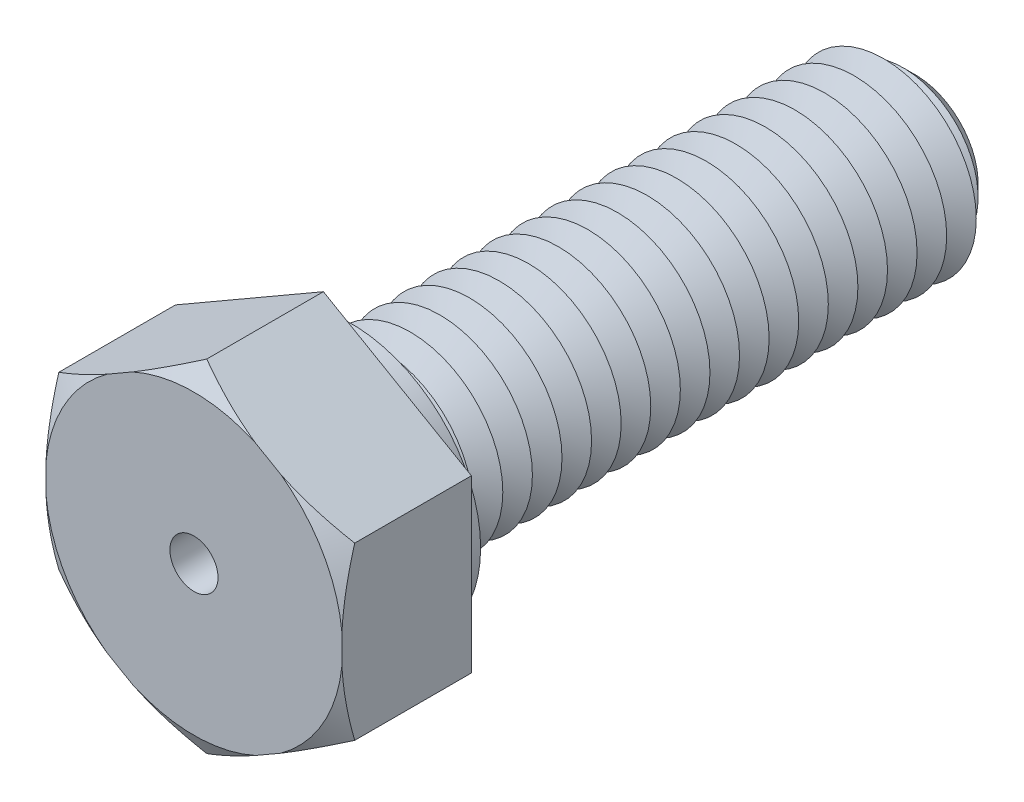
ISO-10303-21;
HEADER;
FILE_DESCRIPTION(('STEP AP214'),'2;1');
FILE_NAME('part.step','',(''),(''),'','','');
FILE_SCHEMA(('AUTOMOTIVE_DESIGN { 1 0 10303 214 1 1 1 1 }'));
ENDSEC;
DATA;
#1=APPLICATION_CONTEXT('core data for automotive mechanical design processes');
#2=APPLICATION_PROTOCOL_DEFINITION('international standard','automotive_design',2000,#1);
#3=PRODUCT_CONTEXT('',#1,'mechanical');
#4=PRODUCT('Part','Part','',(#3));
#5=PRODUCT_RELATED_PRODUCT_CATEGORY('part','',(#4));
#6=PRODUCT_DEFINITION_FORMATION('','',#4);
#7=PRODUCT_DEFINITION_CONTEXT('part definition',#1,'design');
#8=PRODUCT_DEFINITION('design','',#6,#7);
#9=PRODUCT_DEFINITION_SHAPE('','',#8);
#10=(LENGTH_UNIT() NAMED_UNIT(*) SI_UNIT(.MILLI.,.METRE.));
#11=(NAMED_UNIT(*) PLANE_ANGLE_UNIT() SI_UNIT($,.RADIAN.));
#12=(NAMED_UNIT(*) SI_UNIT($,.STERADIAN.) SOLID_ANGLE_UNIT());
#13=UNCERTAINTY_MEASURE_WITH_UNIT(LENGTH_MEASURE(1.E-05),#10,'distance_accuracy_value','');
#14=(GEOMETRIC_REPRESENTATION_CONTEXT(3) GLOBAL_UNCERTAINTY_ASSIGNED_CONTEXT((#13)) GLOBAL_UNIT_ASSIGNED_CONTEXT((#10,
#11,#12)) REPRESENTATION_CONTEXT('',''));
#15=CARTESIAN_POINT('',(0.,0.,0.));
#16=DIRECTION('',(0.,0.,1.));
#17=DIRECTION('',(1.,0.,0.));
#18=AXIS2_PLACEMENT_3D('',#15,#16,#17);
#19=CARTESIAN_POINT('',(4.,2.3094010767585,3.5));
#20=DIRECTION('',(-0.5,-0.866025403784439,0.));
#21=DIRECTION('',(0.866025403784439,-0.5,0.));
#22=AXIS2_PLACEMENT_3D('',#19,#20,#21);
#23=PLANE('',#22);
#24=CARTESIAN_POINT('',(6.77926459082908,0.704791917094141,1.88515125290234));
#25=CARTESIAN_POINT('',(6.65357706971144,0.777357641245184,1.95298106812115));
#26=CARTESIAN_POINT('',(6.52758896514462,0.850096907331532,2.02007962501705));
#27=CARTESIAN_POINT('',(6.2748848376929,0.995995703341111,2.15247084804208));
#28=CARTESIAN_POINT('',(6.14816872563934,1.06915528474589,2.21776328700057));
#29=CARTESIAN_POINT('',(5.8935057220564,1.21618503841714,2.34638757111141));
#30=CARTESIAN_POINT('',(5.76555618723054,1.29005673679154,2.40971246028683));
#31=CARTESIAN_POINT('',(5.50869902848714,1.43835328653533,2.53371033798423));
#32=CARTESIAN_POINT('',(5.37979143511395,1.51277812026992,2.59438341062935));
#33=CARTESIAN_POINT('',(5.11756014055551,1.66417742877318,2.7140043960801));
#34=CARTESIAN_POINT('',(4.98420771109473,1.74116848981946,2.77286873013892));
#35=CARTESIAN_POINT('',(4.7161724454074,1.89591872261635,2.88640197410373));
#36=CARTESIAN_POINT('',(4.58148968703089,1.97367784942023,2.94107112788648));
#37=CARTESIAN_POINT('',(4.31074083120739,2.12999477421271,3.0451841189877));
#38=CARTESIAN_POINT('',(4.17467611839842,2.20855177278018,3.09463271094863));
#39=CARTESIAN_POINT('',(3.90094921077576,2.36658807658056,3.18716064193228));
#40=CARTESIAN_POINT('',(3.76328722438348,2.44606726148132,3.23024080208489));
#41=CARTESIAN_POINT('',(3.43409497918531,2.63612649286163,3.32342391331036));
#42=CARTESIAN_POINT('',(3.24179802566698,2.74714919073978,3.37006382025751));
#43=CARTESIAN_POINT('',(2.95137883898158,2.91482278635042,3.4261412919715));
#44=CARTESIAN_POINT('',(2.85424512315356,2.97090296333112,3.44251989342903));
#45=CARTESIAN_POINT('',(2.65944416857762,3.08337134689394,3.47023794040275));
#46=CARTESIAN_POINT('',(2.56177700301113,3.13975951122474,3.48157806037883));
#47=CARTESIAN_POINT('',(2.36721602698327,3.25208934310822,3.49879538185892));
#48=CARTESIAN_POINT('',(2.27032632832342,3.30802863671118,3.50473421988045));
#49=CARTESIAN_POINT('',(2.07641108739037,3.41998565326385,3.51119583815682));
#50=CARTESIAN_POINT('',(1.97938554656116,3.47600337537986,3.51171867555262));
#51=CARTESIAN_POINT('',(1.78542763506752,3.58798502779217,3.50733170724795));
#52=CARTESIAN_POINT('',(1.68849526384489,3.64394895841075,3.50242193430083));
#53=CARTESIAN_POINT('',(1.49492986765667,3.75570399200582,3.48731840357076));
#54=CARTESIAN_POINT('',(1.39829689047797,3.81149506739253,3.47712384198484));
#55=CARTESIAN_POINT('',(1.1701117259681,3.94323783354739,3.44706969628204));
#56=CARTESIAN_POINT('',(1.03877271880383,4.01906644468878,3.42503535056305));
#57=CARTESIAN_POINT('',(0.777349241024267,4.16999935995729,3.37264454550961));
#58=CARTESIAN_POINT('',(0.64726495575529,4.24510355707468,3.34228687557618));
#59=CARTESIAN_POINT('',(0.388367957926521,4.3945778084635,3.27439527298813));
#60=CARTESIAN_POINT('',(0.259556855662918,4.46894693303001,3.2368532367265));
#61=CARTESIAN_POINT('',(0.00337956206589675,4.61685096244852,3.15577578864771));
#62=CARTESIAN_POINT('',(-0.123986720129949,4.69038591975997,3.11224075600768));
#63=CARTESIAN_POINT('',(-0.378873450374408,4.83754484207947,3.01966290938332));
#64=CARTESIAN_POINT('',(-0.506377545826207,4.91115936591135,2.97056048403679));
#65=CARTESIAN_POINT('',(-0.760034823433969,5.0576084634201,2.86822484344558));
#66=CARTESIAN_POINT('',(-0.886188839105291,5.13044351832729,2.81499436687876));
#67=CARTESIAN_POINT('',(-1.13734672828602,5.27544959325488,2.70513446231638));
#68=CARTESIAN_POINT('',(-1.26235083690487,5.34762074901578,2.6485057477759));
#69=CARTESIAN_POINT('',(-1.5113783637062,5.49139685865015,2.53244390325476));
#70=CARTESIAN_POINT('',(-1.63540176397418,5.56300180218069,2.47301072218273));
#71=CARTESIAN_POINT('',(-1.84520240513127,5.68413025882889,2.37015667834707));
#72=CARTESIAN_POINT('',(-1.93119941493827,5.73378065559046,2.32733101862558));
#73=CARTESIAN_POINT('',(-2.1028145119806,5.83286267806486,2.24068817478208));
#74=CARTESIAN_POINT('',(-2.18843261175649,5.88229431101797,2.19687102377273));
#75=CARTESIAN_POINT('',(-2.3584228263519,5.98043820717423,2.10883190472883));
#76=CARTESIAN_POINT('',(-2.44279852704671,6.02915254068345,2.06461915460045));
#77=CARTESIAN_POINT('',(-2.61124951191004,6.12640776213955,1.97543229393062));
#78=CARTESIAN_POINT('',(-2.6953247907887,6.17494864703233,1.93045817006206));
#79=CARTESIAN_POINT('',(-2.77926459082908,6.22341131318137,1.88515125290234));
#80=B_SPLINE_CURVE_WITH_KNOTS('',3,(#24,#25,#26,#27,#28,#29,#30,#31,#32,#33,#34,#35,#36,#37,#38,
#39,#40,#41,#42,#43,#44,#45,#46,#47,#48,#49,#50,#51,#52,#53,#54,#55,#56,#57,#58,#59,#60,#61,#62,
#63,#64,#65,#66,#67,#68,#69,#70,#71,#72,#73,#74,#75,#76,#77,#78,#79),.UNSPECIFIED.,.F.,.F.,(4,2,
2,2,2,2,2,2,2,2,2,2,2,2,2,2,2,2,2,2,2,2,2,2,2,2,2,4),(0.,0.480604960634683,0.96127009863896,
1.44347608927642,1.92566677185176,2.42016676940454,2.91463799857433,3.4086549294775,
3.9026081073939,4.58254272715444,4.92249867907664,5.26240911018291,5.59839013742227,
5.93436761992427,6.27034307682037,6.60636964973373,7.06584039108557,7.52537799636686,
7.98543702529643,8.44546695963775,8.91099531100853,9.37621741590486,9.84134218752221,
10.3064754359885,10.6308960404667,10.9553058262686,11.2762760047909,11.5972518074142),.UNSPECIFIED.);
#81=CARTESIAN_POINT('',(4.,2.3094010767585,3.15358983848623));
#82=VERTEX_POINT('',#81);
#83=CARTESIAN_POINT('',(2.33627081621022,3.26995556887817,3.5));
#84=VERTEX_POINT('',#83);
#85=EDGE_CURVE('E132',#82,#84,#80,.T.);
#86=ORIENTED_EDGE('',*,*,#85,.F.);
#87=DIRECTION('',(0.,0.,-1.));
#88=VECTOR('',#87,1.);
#89=CARTESIAN_POINT('',(4.,2.3094010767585,3.5));
#90=LINE('',#89,#88);
#91=CARTESIAN_POINT('',(4.,2.3094010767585,0.));
#92=VERTEX_POINT('',#91);
#93=EDGE_CURVE('E144',#82,#92,#90,.T.);
#94=ORIENTED_EDGE('',*,*,#93,.T.);
#95=DIRECTION('',(-0.866025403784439,0.5,0.));
#96=VECTOR('',#95,1.);
#97=CARTESIAN_POINT('',(4.,2.3094010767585,0.));
#98=LINE('',#97,#96);
#99=CARTESIAN_POINT('',(0.,4.618802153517,0.));
#100=VERTEX_POINT('',#99);
#101=EDGE_CURVE('E354',#92,#100,#98,.T.);
#102=ORIENTED_EDGE('',*,*,#101,.T.);
#103=DIRECTION('',(0.,0.,-1.));
#104=VECTOR('',#103,1.);
#105=CARTESIAN_POINT('',(0.,4.618802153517,3.5));
#106=LINE('',#105,#104);
#107=CARTESIAN_POINT('',(0.,4.61880215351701,3.15358983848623));
#108=VERTEX_POINT('',#107);
#109=EDGE_CURVE('E179',#108,#100,#106,.T.);
#110=ORIENTED_EDGE('',*,*,#109,.F.);
#111=CARTESIAN_POINT('',(1.66372918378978,3.65824766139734,3.5));
#112=VERTEX_POINT('',#111);
#113=EDGE_CURVE('E151',#112,#108,#80,.T.);
#114=ORIENTED_EDGE('',*,*,#113,.F.);
#115=DIRECTION('',(-0.866025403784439,0.5,0.));
#116=VECTOR('',#115,1.);
#117=CARTESIAN_POINT('',(4.,2.3094010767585,3.5));
#118=LINE('',#117,#116);
#119=EDGE_CURVE('E148',#84,#112,#118,.T.);
#120=ORIENTED_EDGE('',*,*,#119,.F.);
#121=EDGE_LOOP('',(#86,#94,#102,#110,#114,#120));
#122=FACE_BOUND('',#121,.T.);
#123=ADVANCED_FACE('F39',(#122),#23,.F.);
#124=CARTESIAN_POINT('',(0.,4.618802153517,3.5));
#125=DIRECTION('',(0.5,-0.866025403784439,0.));
#126=DIRECTION('',(0.866025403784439,0.5,0.));
#127=AXIS2_PLACEMENT_3D('',#124,#125,#126);
#128=PLANE('',#127);
#129=CARTESIAN_POINT('',(2.77926459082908,6.22341131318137,1.88515125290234));
#130=CARTESIAN_POINT('',(2.65357706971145,6.15084558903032,1.95298106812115));
#131=CARTESIAN_POINT('',(2.52758896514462,6.07810632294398,2.02007962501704));
#132=CARTESIAN_POINT('',(2.2748848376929,5.9322075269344,2.15247084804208));
#133=CARTESIAN_POINT('',(2.14816872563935,5.85904794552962,2.21776328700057));
#134=CARTESIAN_POINT('',(1.89350572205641,5.71201819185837,2.3463875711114));
#135=CARTESIAN_POINT('',(1.76555618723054,5.63814649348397,2.40971246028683));
#136=CARTESIAN_POINT('',(1.50869902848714,5.48984994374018,2.53371033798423));
#137=CARTESIAN_POINT('',(1.37979143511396,5.41542511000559,2.59438341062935));
#138=CARTESIAN_POINT('',(1.11756014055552,5.26402580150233,2.7140043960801));
#139=CARTESIAN_POINT('',(0.984207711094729,5.18703474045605,2.77286873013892));
#140=CARTESIAN_POINT('',(0.716172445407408,5.03228450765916,2.88640197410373));
#141=CARTESIAN_POINT('',(0.581489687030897,4.95452538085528,2.94107112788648));
#142=CARTESIAN_POINT('',(0.310740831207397,4.7982084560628,3.0451841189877));
#143=CARTESIAN_POINT('',(0.174676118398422,4.71965145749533,3.09463271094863));
#144=CARTESIAN_POINT('',(-0.0990507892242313,4.56161515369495,3.18716064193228));
#145=CARTESIAN_POINT('',(-0.236712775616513,4.48213596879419,3.23024080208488));
#146=CARTESIAN_POINT('',(-0.565905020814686,4.29207673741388,3.32342391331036));
#147=CARTESIAN_POINT('',(-0.758201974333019,4.18105403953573,3.37006382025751));
#148=CARTESIAN_POINT('',(-1.04862116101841,4.01338044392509,3.4261412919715));
#149=CARTESIAN_POINT('',(-1.14575487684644,3.95730026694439,3.44251989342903));
#150=CARTESIAN_POINT('',(-1.34055583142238,3.84483188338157,3.47023794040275));
#151=CARTESIAN_POINT('',(-1.43822299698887,3.78844371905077,3.48157806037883));
#152=CARTESIAN_POINT('',(-1.63278397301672,3.67611388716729,3.49879538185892));
#153=CARTESIAN_POINT('',(-1.72967367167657,3.62017459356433,3.50473421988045));
#154=CARTESIAN_POINT('',(-1.92358891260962,3.50821757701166,3.51119583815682));
#155=CARTESIAN_POINT('',(-2.02061445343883,3.45219985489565,3.51171867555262));
#156=CARTESIAN_POINT('',(-2.21457236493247,3.34021820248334,3.50733170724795));
#157=CARTESIAN_POINT('',(-2.3115047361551,3.28425427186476,3.50242193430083));
#158=CARTESIAN_POINT('',(-2.50507013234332,3.1724992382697,3.48731840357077));
#159=CARTESIAN_POINT('',(-2.60170310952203,3.11670816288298,3.47712384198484));
#160=CARTESIAN_POINT('',(-2.82988827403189,2.98496539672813,3.44706969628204));
#161=CARTESIAN_POINT('',(-2.96122728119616,2.90913678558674,3.42503535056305));
#162=CARTESIAN_POINT('',(-3.22265075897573,2.75820387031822,3.37264454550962));
#163=CARTESIAN_POINT('',(-3.3527350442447,2.68309967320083,3.34228687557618));
#164=CARTESIAN_POINT('',(-3.61163204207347,2.53362542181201,3.27439527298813));
#165=CARTESIAN_POINT('',(-3.74044314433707,2.4592562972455,3.23685323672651));
#166=CARTESIAN_POINT('',(-3.99662043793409,2.311352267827,3.15577578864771));
#167=CARTESIAN_POINT('',(-4.12398672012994,2.23781731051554,3.11224075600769));
#168=CARTESIAN_POINT('',(-4.3788734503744,2.09065838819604,3.01966290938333));
#169=CARTESIAN_POINT('',(-4.5063775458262,2.01704386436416,2.97056048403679));
#170=CARTESIAN_POINT('',(-4.76003482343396,1.87059476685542,2.86822484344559));
#171=CARTESIAN_POINT('',(-4.88618883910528,1.79775971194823,2.81499436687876));
#172=CARTESIAN_POINT('',(-5.13734672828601,1.65275363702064,2.70513446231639));
#173=CARTESIAN_POINT('',(-5.26235083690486,1.58058248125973,2.64850574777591));
#174=CARTESIAN_POINT('',(-5.51137836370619,1.43680637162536,2.53244390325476));
#175=CARTESIAN_POINT('',(-5.63540176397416,1.36520142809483,2.47301072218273));
#176=CARTESIAN_POINT('',(-5.84520240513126,1.24407297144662,2.37015667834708));
#177=CARTESIAN_POINT('',(-5.93119941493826,1.19442257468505,2.32733101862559));
#178=CARTESIAN_POINT('',(-6.1028145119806,1.09534055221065,2.24068817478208));
#179=CARTESIAN_POINT('',(-6.18843261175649,1.04590891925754,2.19687102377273));
#180=CARTESIAN_POINT('',(-6.3584228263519,0.947765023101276,2.10883190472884));
#181=CARTESIAN_POINT('',(-6.44279852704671,0.899050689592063,2.06461915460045));
#182=CARTESIAN_POINT('',(-6.61124951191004,0.80179546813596,1.97543229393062));
#183=CARTESIAN_POINT('',(-6.6953247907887,0.753254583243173,1.93045817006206));
#184=CARTESIAN_POINT('',(-6.77926459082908,0.704791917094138,1.88515125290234));
#185=B_SPLINE_CURVE_WITH_KNOTS('',3,(#129,#130,#131,#132,#133,#134,#135,#136,#137,#138,#139,
#140,#141,#142,#143,#144,#145,#146,#147,#148,#149,#150,#151,#152,#153,#154,#155,#156,#157,#158,
#159,#160,#161,#162,#163,#164,#165,#166,#167,#168,#169,#170,#171,#172,#173,#174,#175,#176,#177,
#178,#179,#180,#181,#182,#183,#184),.UNSPECIFIED.,.F.,.F.,(4,2,2,2,2,2,2,2,2,2,2,2,2,2,2,2,2,2,
2,2,2,2,2,2,2,2,2,4),(0.,0.480604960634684,0.961270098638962,1.44347608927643,1.92566677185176,
2.42016676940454,2.91463799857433,3.4086549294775,3.9026081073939,4.58254272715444,
4.92249867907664,5.26240911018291,5.59839013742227,5.93436761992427,6.27034307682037,
6.60636964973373,7.06584039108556,7.52537799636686,7.98543702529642,8.44546695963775,
8.91099531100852,9.37621741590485,9.8413421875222,10.3064754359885,10.6308960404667,
10.9553058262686,11.2762760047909,11.5972518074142),.UNSPECIFIED.);
#186=CARTESIAN_POINT('',(-1.66372918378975,3.65824766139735,3.5));
#187=VERTEX_POINT('',#186);
#188=EDGE_CURVE('E403',#108,#187,#185,.T.);
#189=ORIENTED_EDGE('',*,*,#188,.F.);
#190=ORIENTED_EDGE('',*,*,#109,.T.);
#191=DIRECTION('',(-0.866025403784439,-0.5,0.));
#192=VECTOR('',#191,1.);
#193=CARTESIAN_POINT('',(0.,4.618802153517,0.));
#194=LINE('',#193,#192);
#195=CARTESIAN_POINT('',(-4.,2.3094010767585,0.));
#196=VERTEX_POINT('',#195);
#197=EDGE_CURVE('E374',#100,#196,#194,.T.);
#198=ORIENTED_EDGE('',*,*,#197,.T.);
#199=DIRECTION('',(0.,0.,-1.));
#200=VECTOR('',#199,1.);
#201=CARTESIAN_POINT('',(-4.,2.3094010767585,3.5));
#202=LINE('',#201,#200);
#203=CARTESIAN_POINT('',(-4.,2.3094010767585,3.15358983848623));
#204=VERTEX_POINT('',#203);
#205=EDGE_CURVE('E176',#204,#196,#202,.T.);
#206=ORIENTED_EDGE('',*,*,#205,.F.);
#207=CARTESIAN_POINT('',(-2.33627081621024,3.26995556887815,3.5));
#208=VERTEX_POINT('',#207);
#209=EDGE_CURVE('E402',#208,#204,#185,.T.);
#210=ORIENTED_EDGE('',*,*,#209,.F.);
#211=DIRECTION('',(-0.866025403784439,-0.5,0.));
#212=VECTOR('',#211,1.);
#213=CARTESIAN_POINT('',(0.,4.618802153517,3.5));
#214=LINE('',#213,#212);
#215=EDGE_CURVE('E357',#187,#208,#214,.T.);
#216=ORIENTED_EDGE('',*,*,#215,.F.);
#217=EDGE_LOOP('',(#189,#190,#198,#206,#210,#216));
#218=FACE_BOUND('',#217,.T.);
#219=ADVANCED_FACE('F421',(#218),#128,.F.);
#220=CARTESIAN_POINT('',(-4.,2.3094010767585,3.5));
#221=DIRECTION('',(1.,0.,0.));
#222=DIRECTION('',(0.,0.,-1.));
#223=AXIS2_PLACEMENT_3D('',#220,#221,#222);
#224=PLANE('',#223);
#225=CARTESIAN_POINT('',(-4.,5.08866566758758,2.08330060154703));
#226=CARTESIAN_POINT('',(-4.,4.94414615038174,2.14888120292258));
#227=CARTESIAN_POINT('',(-4.,4.79923170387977,2.21360759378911));
#228=CARTESIAN_POINT('',(-4.,4.5084433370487,2.34093771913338));
#229=CARTESIAN_POINT('',(-4.,4.36256924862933,2.4035410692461));
#230=CARTESIAN_POINT('',(-4.,4.06913305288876,2.52644280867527));
#231=CARTESIAN_POINT('',(-4.,3.92156644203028,2.58673049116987));
#232=CARTESIAN_POINT('',(-4.,3.62518774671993,2.70415001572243));
#233=CARTESIAN_POINT('',(-4.,3.47637571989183,2.76128200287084));
#234=CARTESIAN_POINT('',(-4.,3.17798204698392,2.87144502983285));
#235=CARTESIAN_POINT('',(-4.,3.02840679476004,2.92449322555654));
#236=CARTESIAN_POINT('',(-4.,2.72767549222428,3.02589725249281));
#237=CARTESIAN_POINT('',(-4.,2.57651933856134,3.07425277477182));
#238=CARTESIAN_POINT('',(-4.,2.12084922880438,3.21062944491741));
#239=CARTESIAN_POINT('',(-4.,1.81364350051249,3.29014850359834));
#240=CARTESIAN_POINT('',(-4.,1.28033133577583,3.39840613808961));
#241=CARTESIAN_POINT('',(-4.,1.05588972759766,3.43514774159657));
#242=CARTESIAN_POINT('',(-4.,0.717455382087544,3.47487260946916));
#243=CARTESIAN_POINT('',(-4.,0.604348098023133,3.48554965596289));
#244=CARTESIAN_POINT('',(-4.,0.377758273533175,3.50148677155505));
#245=CARTESIAN_POINT('',(-4.,0.264275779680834,3.50674748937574));
#246=CARTESIAN_POINT('',(-4.,0.0372413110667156,3.51168400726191));
#247=CARTESIAN_POINT('',(-4.,-0.0763106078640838,3.51136237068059));
#248=CARTESIAN_POINT('',(-4.,-0.303259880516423,3.50515259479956));
#249=CARTESIAN_POINT('',(-4.,-0.416657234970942,3.49926448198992));
#250=CARTESIAN_POINT('',(-4.,-0.643045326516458,3.48210091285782));
#251=CARTESIAN_POINT('',(-4.,-0.756036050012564,3.47082527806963));
#252=CARTESIAN_POINT('',(-4.,-0.981405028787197,3.44321260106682));
#253=CARTESIAN_POINT('',(-4.,-1.09378317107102,3.42687465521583));
#254=CARTESIAN_POINT('',(-4.,-1.54188975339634,3.35219605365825));
#255=CARTESIAN_POINT('',(-4.,-1.87460189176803,3.27522286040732));
#256=CARTESIAN_POINT('',(-4.,-2.36751874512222,3.1379521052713));
#257=CARTESIAN_POINT('',(-4.,-2.53101356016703,3.08847923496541));
#258=CARTESIAN_POINT('',(-4.,-2.85611626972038,2.98363580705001));
#259=CARTESIAN_POINT('',(-4.,-3.01772429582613,2.92826566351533));
#260=CARTESIAN_POINT('',(-4.,-3.34106601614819,2.81212836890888));
#261=CARTESIAN_POINT('',(-4.,-3.50277978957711,2.75130648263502));
#262=CARTESIAN_POINT('',(-4.,-3.82469686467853,2.62576992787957));
#263=CARTESIAN_POINT('',(-4.,-3.98490007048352,2.56105501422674));
#264=CARTESIAN_POINT('',(-4.,-4.30300593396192,2.4289095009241));
#265=CARTESIAN_POINT('',(-4.,-4.46091670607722,2.36149833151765));
#266=CARTESIAN_POINT('',(-4.,-4.7755935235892,2.22415533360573));
#267=CARTESIAN_POINT('',(-4.,-4.93235984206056,2.15422413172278));
#268=CARTESIAN_POINT('',(-4.,-5.08866566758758,2.08330060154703));
#269=B_SPLINE_CURVE_WITH_KNOTS('',3,(#225,#226,#227,#228,#229,#230,#231,#232,#233,#234,#235,
#236,#237,#238,#239,#240,#241,#242,#243,#244,#245,#246,#247,#248,#249,#250,#251,#252,#253,#254,
#255,#256,#257,#258,#259,#260,#261,#262,#263,#264,#265,#266,#267,#268),.UNSPECIFIED.,.F.,.F.,(4,
2,2,2,2,2,2,2,2,2,2,2,2,2,2,2,2,2,2,2,2,4),(0.,0.476116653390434,0.952319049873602,
1.43050831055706,1.90867556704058,2.38470991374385,2.8607755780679,3.81133518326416,
4.49276221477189,4.83347879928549,5.17415457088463,5.51467391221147,5.85519163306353,
6.19572063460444,6.53631045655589,7.5583874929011,8.07079781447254,8.58317218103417,
9.1014378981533,9.61973628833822,10.1348057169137,10.6497479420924),.UNSPECIFIED.);
#270=CARTESIAN_POINT('',(-4.,0.388292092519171,3.5));
#271=VERTEX_POINT('',#270);
#272=EDGE_CURVE('E404',#204,#271,#269,.T.);
#273=ORIENTED_EDGE('',*,*,#272,.F.);
#274=ORIENTED_EDGE('',*,*,#205,.T.);
#275=DIRECTION('',(0.,-1.,0.));
#276=VECTOR('',#275,1.);
#277=CARTESIAN_POINT('',(-4.,2.3094010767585,0.));
#278=LINE('',#277,#276);
#279=CARTESIAN_POINT('',(-4.,-2.3094010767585,0.));
#280=VERTEX_POINT('',#279);
#281=EDGE_CURVE('E378',#196,#280,#278,.T.);
#282=ORIENTED_EDGE('',*,*,#281,.T.);
#283=DIRECTION('',(0.,0.,-1.));
#284=VECTOR('',#283,1.);
#285=CARTESIAN_POINT('',(-4.,-2.3094010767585,3.5));
#286=LINE('',#285,#284);
#287=CARTESIAN_POINT('',(-4.,-2.30940107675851,3.15358983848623));
#288=VERTEX_POINT('',#287);
#289=EDGE_CURVE('E173',#288,#280,#286,.T.);
#290=ORIENTED_EDGE('',*,*,#289,.F.);
#291=CARTESIAN_POINT('',(-4.,-0.388292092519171,3.5));
#292=VERTEX_POINT('',#291);
#293=EDGE_CURVE('E409',#292,#288,#269,.T.);
#294=ORIENTED_EDGE('',*,*,#293,.F.);
#295=DIRECTION('',(0.,-1.,0.));
#296=VECTOR('',#295,1.);
#297=CARTESIAN_POINT('',(-4.,2.3094010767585,3.5));
#298=LINE('',#297,#296);
#299=EDGE_CURVE('E361',#271,#292,#298,.T.);
#300=ORIENTED_EDGE('',*,*,#299,.F.);
#301=EDGE_LOOP('',(#273,#274,#282,#290,#294,#300));
#302=FACE_BOUND('',#301,.T.);
#303=ADVANCED_FACE('F458',(#302),#224,.F.);
#304=CARTESIAN_POINT('',(-4.,-2.3094010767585,3.5));
#305=DIRECTION('',(0.5,0.866025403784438,0.));
#306=DIRECTION('',(-0.866025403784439,0.5,0.));
#307=AXIS2_PLACEMENT_3D('',#304,#305,#306);
#308=PLANE('',#307);
#309=CARTESIAN_POINT('',(-6.77926459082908,-0.704791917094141,1.88515125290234));
#310=CARTESIAN_POINT('',(-6.65357706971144,-0.777357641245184,1.95298106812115));
#311=CARTESIAN_POINT('',(-6.52758896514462,-0.850096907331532,2.02007962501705));
#312=CARTESIAN_POINT('',(-6.2748848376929,-0.995995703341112,2.15247084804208));
#313=CARTESIAN_POINT('',(-6.14816872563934,-1.06915528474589,2.21776328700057));
#314=CARTESIAN_POINT('',(-5.8935057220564,-1.21618503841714,2.34638757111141));
#315=CARTESIAN_POINT('',(-5.76555618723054,-1.29005673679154,2.40971246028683));
#316=CARTESIAN_POINT('',(-5.50869902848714,-1.43835328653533,2.53371033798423));
#317=CARTESIAN_POINT('',(-5.37979143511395,-1.51277812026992,2.59438341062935));
#318=CARTESIAN_POINT('',(-5.11756014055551,-1.66417742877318,2.71400439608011));
#319=CARTESIAN_POINT('',(-4.98420771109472,-1.74116848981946,2.77286873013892));
#320=CARTESIAN_POINT('',(-4.7161724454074,-1.89591872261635,2.88640197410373));
#321=CARTESIAN_POINT('',(-4.58148968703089,-1.97367784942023,2.94107112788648));
#322=CARTESIAN_POINT('',(-4.31074083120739,-2.12999477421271,3.0451841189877));
#323=CARTESIAN_POINT('',(-4.17467611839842,-2.20855177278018,3.09463271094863));
#324=CARTESIAN_POINT('',(-3.90094921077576,-2.36658807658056,3.18716064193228));
#325=CARTESIAN_POINT('',(-3.76328722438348,-2.44606726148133,3.23024080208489));
#326=CARTESIAN_POINT('',(-3.43409497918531,-2.63612649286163,3.32342391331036));
#327=CARTESIAN_POINT('',(-3.24179802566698,-2.74714919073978,3.3700638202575));
#328=CARTESIAN_POINT('',(-2.95137883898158,-2.91482278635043,3.4261412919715));
#329=CARTESIAN_POINT('',(-2.85424512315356,-2.97090296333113,3.44251989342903));
#330=CARTESIAN_POINT('',(-2.65944416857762,-3.08337134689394,3.47023794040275));
#331=CARTESIAN_POINT('',(-2.56177700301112,-3.13975951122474,3.48157806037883));
#332=CARTESIAN_POINT('',(-2.36721602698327,-3.25208934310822,3.49879538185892));
#333=CARTESIAN_POINT('',(-2.27032632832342,-3.30802863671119,3.50473421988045));
#334=CARTESIAN_POINT('',(-2.07641108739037,-3.41998565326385,3.51119583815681));
#335=CARTESIAN_POINT('',(-1.97938554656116,-3.47600337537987,3.51171867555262));
#336=CARTESIAN_POINT('',(-1.78542763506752,-3.58798502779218,3.50733170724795));
#337=CARTESIAN_POINT('',(-1.68849526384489,-3.64394895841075,3.50242193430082));
#338=CARTESIAN_POINT('',(-1.49492986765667,-3.75570399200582,3.48731840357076));
#339=CARTESIAN_POINT('',(-1.39829689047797,-3.81149506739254,3.47712384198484));
#340=CARTESIAN_POINT('',(-1.1701117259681,-3.94323783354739,3.44706969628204));
#341=CARTESIAN_POINT('',(-1.03877271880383,-4.01906644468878,3.42503535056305));
#342=CARTESIAN_POINT('',(-0.777349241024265,-4.1699993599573,3.37264454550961));
#343=CARTESIAN_POINT('',(-0.647264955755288,-4.24510355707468,3.34228687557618));
#344=CARTESIAN_POINT('',(-0.388367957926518,-4.39457780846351,3.27439527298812));
#345=CARTESIAN_POINT('',(-0.259556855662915,-4.46894693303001,3.2368532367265));
#346=CARTESIAN_POINT('',(-0.00337956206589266,-4.61685096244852,3.1557757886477));
#347=CARTESIAN_POINT('',(0.123986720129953,-4.69038591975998,3.11224075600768));
#348=CARTESIAN_POINT('',(0.378873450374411,-4.83754484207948,3.01966290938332));
#349=CARTESIAN_POINT('',(0.50637754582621,-4.91115936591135,2.97056048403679));
#350=CARTESIAN_POINT('',(0.760034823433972,-5.0576084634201,2.86822484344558));
#351=CARTESIAN_POINT('',(0.886188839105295,-5.13044351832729,2.81499436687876));
#352=CARTESIAN_POINT('',(1.13734672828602,-5.27544959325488,2.70513446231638));
#353=CARTESIAN_POINT('',(1.26235083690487,-5.34762074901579,2.6485057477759));
#354=CARTESIAN_POINT('',(1.5113783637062,-5.49139685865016,2.53244390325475));
#355=CARTESIAN_POINT('',(1.63540176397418,-5.56300180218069,2.47301072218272));
#356=CARTESIAN_POINT('',(1.84520240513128,-5.6841302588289,2.37015667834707));
#357=CARTESIAN_POINT('',(1.93119941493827,-5.73378065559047,2.32733101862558));
#358=CARTESIAN_POINT('',(2.10281451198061,-5.83286267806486,2.24068817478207));
#359=CARTESIAN_POINT('',(2.1884326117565,-5.88229431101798,2.19687102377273));
#360=CARTESIAN_POINT('',(2.3584228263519,-5.98043820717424,2.10883190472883));
#361=CARTESIAN_POINT('',(2.44279852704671,-6.02915254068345,2.06461915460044));
#362=CARTESIAN_POINT('',(2.61124951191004,-6.12640776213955,1.97543229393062));
#363=CARTESIAN_POINT('',(2.6953247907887,-6.17494864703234,1.93045817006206));
#364=CARTESIAN_POINT('',(2.77926459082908,-6.22341131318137,1.88515125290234));
#365=B_SPLINE_CURVE_WITH_KNOTS('',3,(#309,#310,#311,#312,#313,#314,#315,#316,#317,#318,#319,
#320,#321,#322,#323,#324,#325,#326,#327,#328,#329,#330,#331,#332,#333,#334,#335,#336,#337,#338,
#339,#340,#341,#342,#343,#344,#345,#346,#347,#348,#349,#350,#351,#352,#353,#354,#355,#356,#357,
#358,#359,#360,#361,#362,#363,#364),.UNSPECIFIED.,.F.,.F.,(4,2,2,2,2,2,2,2,2,2,2,2,2,2,2,2,2,2,
2,2,2,2,2,2,2,2,2,4),(0.,0.480604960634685,0.961270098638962,1.44347608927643,1.92566677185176,
2.42016676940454,2.91463799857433,3.4086549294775,3.90260810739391,4.58254272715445,
4.92249867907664,5.26240911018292,5.59839013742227,5.93436761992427,6.27034307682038,
6.60636964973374,7.06584039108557,7.52537799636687,7.98543702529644,8.44546695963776,
8.91099531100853,9.37621741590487,9.84134218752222,10.3064754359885,10.6308960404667,
10.9553058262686,11.2762760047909,11.5972518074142),.UNSPECIFIED.);
#366=CARTESIAN_POINT('',(-2.3362708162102,-3.26995556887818,3.5));
#367=VERTEX_POINT('',#366);
#368=EDGE_CURVE('E453',#288,#367,#365,.T.);
#369=ORIENTED_EDGE('',*,*,#368,.F.);
#370=ORIENTED_EDGE('',*,*,#289,.T.);
#371=DIRECTION('',(0.866025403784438,-0.5,0.));
#372=VECTOR('',#371,1.);
#373=CARTESIAN_POINT('',(-4.,-2.3094010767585,0.));
#374=LINE('',#373,#372);
#375=CARTESIAN_POINT('',(0.,-4.61880215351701,0.));
#376=VERTEX_POINT('',#375);
#377=EDGE_CURVE('E382',#280,#376,#374,.T.);
#378=ORIENTED_EDGE('',*,*,#377,.T.);
#379=DIRECTION('',(0.,0.,-1.));
#380=VECTOR('',#379,1.);
#381=CARTESIAN_POINT('',(0.,-4.61880215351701,3.5));
#382=LINE('',#381,#380);
#383=CARTESIAN_POINT('',(0.,-4.618802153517,3.15358983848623));
#384=VERTEX_POINT('',#383);
#385=EDGE_CURVE('E163',#384,#376,#382,.T.);
#386=ORIENTED_EDGE('',*,*,#385,.F.);
#387=CARTESIAN_POINT('',(-1.6637291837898,-3.65824766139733,3.5));
#388=VERTEX_POINT('',#387);
#389=EDGE_CURVE('E398',#388,#384,#365,.T.);
#390=ORIENTED_EDGE('',*,*,#389,.F.);
#391=DIRECTION('',(0.866025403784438,-0.5,0.));
#392=VECTOR('',#391,1.);
#393=CARTESIAN_POINT('',(-4.,-2.3094010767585,3.5));
#394=LINE('',#393,#392);
#395=EDGE_CURVE('E365',#367,#388,#394,.T.);
#396=ORIENTED_EDGE('',*,*,#395,.F.);
#397=EDGE_LOOP('',(#369,#370,#378,#386,#390,#396));
#398=FACE_BOUND('',#397,.T.);
#399=ADVANCED_FACE('F454',(#398),#308,.F.);
#400=CARTESIAN_POINT('',(0.,-4.61880215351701,3.5));
#401=DIRECTION('',(-0.5,0.866025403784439,0.));
#402=DIRECTION('',(-0.866025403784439,-0.5,0.));
#403=AXIS2_PLACEMENT_3D('',#400,#401,#402);
#404=PLANE('',#403);
#405=CARTESIAN_POINT('',(-2.77926459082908,-6.22341131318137,1.88515125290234));
#406=CARTESIAN_POINT('',(-2.65357706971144,-6.15084558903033,1.95298106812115));
#407=CARTESIAN_POINT('',(-2.52758896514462,-6.07810632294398,2.02007962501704));
#408=CARTESIAN_POINT('',(-2.2748848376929,-5.9322075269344,2.15247084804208));
#409=CARTESIAN_POINT('',(-2.14816872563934,-5.85904794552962,2.21776328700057));
#410=CARTESIAN_POINT('',(-1.8935057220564,-5.71201819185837,2.3463875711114));
#411=CARTESIAN_POINT('',(-1.76555618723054,-5.63814649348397,2.40971246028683));
#412=CARTESIAN_POINT('',(-1.50869902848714,-5.48984994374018,2.53371033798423));
#413=CARTESIAN_POINT('',(-1.37979143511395,-5.41542511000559,2.59438341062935));
#414=CARTESIAN_POINT('',(-1.11756014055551,-5.26402580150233,2.7140043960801));
#415=CARTESIAN_POINT('',(-0.984207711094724,-5.18703474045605,2.77286873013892));
#416=CARTESIAN_POINT('',(-0.716172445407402,-5.03228450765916,2.88640197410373));
#417=CARTESIAN_POINT('',(-0.581489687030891,-4.95452538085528,2.94107112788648));
#418=CARTESIAN_POINT('',(-0.310740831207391,-4.7982084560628,3.0451841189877));
#419=CARTESIAN_POINT('',(-0.174676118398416,-4.71965145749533,3.09463271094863));
#420=CARTESIAN_POINT('',(0.0990507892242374,-4.56161515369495,3.18716064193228));
#421=CARTESIAN_POINT('',(0.236712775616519,-4.48213596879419,3.23024080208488));
#422=CARTESIAN_POINT('',(0.565905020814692,-4.29207673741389,3.32342391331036));
#423=CARTESIAN_POINT('',(0.758201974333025,-4.18105403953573,3.37006382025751));
#424=CARTESIAN_POINT('',(1.04862116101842,-4.01338044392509,3.4261412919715));
#425=CARTESIAN_POINT('',(1.14575487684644,-3.95730026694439,3.44251989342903));
#426=CARTESIAN_POINT('',(1.34055583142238,-3.84483188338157,3.47023794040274));
#427=CARTESIAN_POINT('',(1.43822299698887,-3.78844371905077,3.48157806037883));
#428=CARTESIAN_POINT('',(1.63278397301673,-3.67611388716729,3.49879538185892));
#429=CARTESIAN_POINT('',(1.72967367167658,-3.62017459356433,3.50473421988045));
#430=CARTESIAN_POINT('',(1.92358891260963,-3.50821757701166,3.51119583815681));
#431=CARTESIAN_POINT('',(2.02061445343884,-3.45219985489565,3.51171867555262));
#432=CARTESIAN_POINT('',(2.21457236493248,-3.34021820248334,3.50733170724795));
#433=CARTESIAN_POINT('',(2.31150473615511,-3.28425427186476,3.50242193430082));
#434=CARTESIAN_POINT('',(2.50507013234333,-3.1724992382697,3.48731840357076));
#435=CARTESIAN_POINT('',(2.60170310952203,-3.11670816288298,3.47712384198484));
#436=CARTESIAN_POINT('',(2.8298882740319,-2.98496539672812,3.44706969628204));
#437=CARTESIAN_POINT('',(2.96122728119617,-2.90913678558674,3.42503535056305));
#438=CARTESIAN_POINT('',(3.22265075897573,-2.75820387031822,3.37264454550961));
#439=CARTESIAN_POINT('',(3.35273504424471,-2.68309967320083,3.34228687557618));
#440=CARTESIAN_POINT('',(3.61163204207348,-2.53362542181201,3.27439527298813));
#441=CARTESIAN_POINT('',(3.74044314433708,-2.4592562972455,3.2368532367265));
#442=CARTESIAN_POINT('',(3.99662043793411,-2.31135226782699,3.15577578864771));
#443=CARTESIAN_POINT('',(4.12398672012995,-2.23781731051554,3.11224075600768));
#444=CARTESIAN_POINT('',(4.37887345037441,-2.09065838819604,3.01966290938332));
#445=CARTESIAN_POINT('',(4.50637754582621,-2.01704386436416,2.97056048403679));
#446=CARTESIAN_POINT('',(4.76003482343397,-1.87059476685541,2.86822484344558));
#447=CARTESIAN_POINT('',(4.8861888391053,-1.79775971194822,2.81499436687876));
#448=CARTESIAN_POINT('',(5.13734672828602,-1.65275363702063,2.70513446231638));
#449=CARTESIAN_POINT('',(5.26235083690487,-1.58058248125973,2.6485057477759));
#450=CARTESIAN_POINT('',(5.5113783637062,-1.43680637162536,2.53244390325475));
#451=CARTESIAN_POINT('',(5.63540176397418,-1.36520142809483,2.47301072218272));
#452=CARTESIAN_POINT('',(5.84520240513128,-1.24407297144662,2.37015667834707));
#453=CARTESIAN_POINT('',(5.93119941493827,-1.19442257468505,2.32733101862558));
#454=CARTESIAN_POINT('',(6.1028145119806,-1.09534055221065,2.24068817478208));
#455=CARTESIAN_POINT('',(6.1884326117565,-1.04590891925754,2.19687102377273));
#456=CARTESIAN_POINT('',(6.3584228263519,-0.947765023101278,2.10883190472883));
#457=CARTESIAN_POINT('',(6.44279852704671,-0.899050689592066,2.06461915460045));
#458=CARTESIAN_POINT('',(6.61124951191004,-0.801795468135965,1.97543229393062));
#459=CARTESIAN_POINT('',(6.6953247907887,-0.753254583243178,1.93045817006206));
#460=CARTESIAN_POINT('',(6.77926459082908,-0.704791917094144,1.88515125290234));
#461=B_SPLINE_CURVE_WITH_KNOTS('',3,(#405,#406,#407,#408,#409,#410,#411,#412,#413,#414,#415,
#416,#417,#418,#419,#420,#421,#422,#423,#424,#425,#426,#427,#428,#429,#430,#431,#432,#433,#434,
#435,#436,#437,#438,#439,#440,#441,#442,#443,#444,#445,#446,#447,#448,#449,#450,#451,#452,#453,
#454,#455,#456,#457,#458,#459,#460),.UNSPECIFIED.,.F.,.F.,(4,2,2,2,2,2,2,2,2,2,2,2,2,2,2,2,2,2,
2,2,2,2,2,2,2,2,2,4),(0.,0.480604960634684,0.961270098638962,1.44347608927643,1.92566677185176,
2.42016676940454,2.91463799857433,3.4086549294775,3.90260810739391,4.58254272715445,
4.92249867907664,5.26240911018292,5.59839013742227,5.93436761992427,6.27034307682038,
6.60636964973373,7.06584039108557,7.52537799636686,7.98543702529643,8.44546695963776,
8.91099531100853,9.37621741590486,9.84134218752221,10.3064754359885,10.6308960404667,
10.9553058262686,11.2762760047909,11.5972518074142),.UNSPECIFIED.);
#462=CARTESIAN_POINT('',(1.6637291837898,-3.65824766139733,3.5));
#463=VERTEX_POINT('',#462);
#464=EDGE_CURVE('E64',#384,#463,#461,.T.);
#465=ORIENTED_EDGE('',*,*,#464,.F.);
#466=ORIENTED_EDGE('',*,*,#385,.T.);
#467=DIRECTION('',(0.866025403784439,0.5,0.));
#468=VECTOR('',#467,1.);
#469=CARTESIAN_POINT('',(0.,-4.61880215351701,0.));
#470=LINE('',#469,#468);
#471=CARTESIAN_POINT('',(4.,-2.30940107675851,0.));
#472=VERTEX_POINT('',#471);
#473=EDGE_CURVE('E385',#376,#472,#470,.T.);
#474=ORIENTED_EDGE('',*,*,#473,.T.);
#475=DIRECTION('',(0.,0.,-1.));
#476=VECTOR('',#475,1.);
#477=CARTESIAN_POINT('',(4.,-2.30940107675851,3.5));
#478=LINE('',#477,#476);
#479=CARTESIAN_POINT('',(4.,-2.3094010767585,3.15358983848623));
#480=VERTEX_POINT('',#479);
#481=EDGE_CURVE('E157',#480,#472,#478,.T.);
#482=ORIENTED_EDGE('',*,*,#481,.F.);
#483=CARTESIAN_POINT('',(2.3362708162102,-3.26995556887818,3.5));
#484=VERTEX_POINT('',#483);
#485=EDGE_CURVE('E399',#484,#480,#461,.T.);
#486=ORIENTED_EDGE('',*,*,#485,.F.);
#487=DIRECTION('',(0.866025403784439,0.5,0.));
#488=VECTOR('',#487,1.);
#489=CARTESIAN_POINT('',(0.,-4.61880215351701,3.5));
#490=LINE('',#489,#488);
#491=EDGE_CURVE('E166',#463,#484,#490,.T.);
#492=ORIENTED_EDGE('',*,*,#491,.F.);
#493=EDGE_LOOP('',(#465,#466,#474,#482,#486,#492));
#494=FACE_BOUND('',#493,.T.);
#495=ADVANCED_FACE('F457',(#494),#404,.F.);
#496=CARTESIAN_POINT('',(4.,-2.30940107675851,3.5));
#497=DIRECTION('',(-1.,0.,0.));
#498=DIRECTION('',(0.,0.,1.));
#499=AXIS2_PLACEMENT_3D('',#496,#497,#498);
#500=PLANE('',#499);
#501=CARTESIAN_POINT('',(4.,-5.08866566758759,2.08330060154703));
#502=CARTESIAN_POINT('',(4.,-4.94414615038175,2.14888120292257));
#503=CARTESIAN_POINT('',(4.,-4.79923170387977,2.21360759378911));
#504=CARTESIAN_POINT('',(4.,-4.50844333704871,2.34093771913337));
#505=CARTESIAN_POINT('',(4.,-4.36256924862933,2.40354106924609));
#506=CARTESIAN_POINT('',(4.,-4.06913305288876,2.52644280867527));
#507=CARTESIAN_POINT('',(4.,-3.92156644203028,2.58673049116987));
#508=CARTESIAN_POINT('',(4.,-3.62518774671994,2.70415001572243));
#509=CARTESIAN_POINT('',(4.,-3.47637571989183,2.76128200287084));
#510=CARTESIAN_POINT('',(4.,-3.17798204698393,2.87144502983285));
#511=CARTESIAN_POINT('',(4.,-3.02840679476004,2.92449322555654));
#512=CARTESIAN_POINT('',(4.,-2.72767549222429,3.02589725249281));
#513=CARTESIAN_POINT('',(4.,-2.57651933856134,3.07425277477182));
#514=CARTESIAN_POINT('',(4.,-2.12084922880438,3.21062944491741));
#515=CARTESIAN_POINT('',(4.,-1.8136435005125,3.29014850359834));
#516=CARTESIAN_POINT('',(4.,-1.28033133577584,3.39840613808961));
#517=CARTESIAN_POINT('',(4.,-1.05588972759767,3.43514774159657));
#518=CARTESIAN_POINT('',(4.,-0.71745538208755,3.47487260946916));
#519=CARTESIAN_POINT('',(4.,-0.604348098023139,3.48554965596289));
#520=CARTESIAN_POINT('',(4.,-0.377758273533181,3.50148677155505));
#521=CARTESIAN_POINT('',(4.,-0.264275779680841,3.50674748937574));
#522=CARTESIAN_POINT('',(4.,-0.0372413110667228,3.51168400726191));
#523=CARTESIAN_POINT('',(4.,0.0763106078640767,3.51136237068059));
#524=CARTESIAN_POINT('',(4.,0.303259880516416,3.50515259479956));
#525=CARTESIAN_POINT('',(4.,0.416657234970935,3.49926448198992));
#526=CARTESIAN_POINT('',(4.,0.643045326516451,3.48210091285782));
#527=CARTESIAN_POINT('',(4.,0.756036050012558,3.47082527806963));
#528=CARTESIAN_POINT('',(4.,0.98140502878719,3.44321260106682));
#529=CARTESIAN_POINT('',(4.,1.09378317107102,3.42687465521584));
#530=CARTESIAN_POINT('',(4.,1.54188975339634,3.35219605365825));
#531=CARTESIAN_POINT('',(4.,1.87460189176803,3.27522286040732));
#532=CARTESIAN_POINT('',(4.,2.36751874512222,3.1379521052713));
#533=CARTESIAN_POINT('',(4.,2.53101356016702,3.08847923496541));
#534=CARTESIAN_POINT('',(4.,2.85611626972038,2.98363580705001));
#535=CARTESIAN_POINT('',(4.,3.01772429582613,2.92826566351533));
#536=CARTESIAN_POINT('',(4.,3.34106601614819,2.81212836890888));
#537=CARTESIAN_POINT('',(4.,3.50277978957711,2.75130648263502));
#538=CARTESIAN_POINT('',(4.,3.82469686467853,2.62576992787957));
#539=CARTESIAN_POINT('',(4.,3.98490007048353,2.56105501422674));
#540=CARTESIAN_POINT('',(4.,4.30300593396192,2.4289095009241));
#541=CARTESIAN_POINT('',(4.,4.46091670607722,2.36149833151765));
#542=CARTESIAN_POINT('',(4.,4.7755935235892,2.22415533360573));
#543=CARTESIAN_POINT('',(4.,4.93235984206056,2.15422413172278));
#544=CARTESIAN_POINT('',(4.,5.08866566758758,2.08330060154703));
#545=B_SPLINE_CURVE_WITH_KNOTS('',3,(#501,#502,#503,#504,#505,#506,#507,#508,#509,#510,#511,
#512,#513,#514,#515,#516,#517,#518,#519,#520,#521,#522,#523,#524,#525,#526,#527,#528,#529,#530,
#531,#532,#533,#534,#535,#536,#537,#538,#539,#540,#541,#542,#543,#544),.UNSPECIFIED.,.F.,.F.,(4,
2,2,2,2,2,2,2,2,2,2,2,2,2,2,2,2,2,2,2,2,4),(0.,0.476116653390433,0.952319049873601,
1.43050831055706,1.90867556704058,2.38470991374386,2.8607755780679,3.81133518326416,
4.49276221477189,4.83347879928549,5.17415457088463,5.51467391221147,5.85519163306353,
6.19572063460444,6.53631045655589,7.5583874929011,8.07079781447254,8.58317218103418,
9.10143789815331,9.61973628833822,10.1348057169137,10.6497479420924),.UNSPECIFIED.);
#546=CARTESIAN_POINT('',(4.,-0.388292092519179,3.5));
#547=VERTEX_POINT('',#546);
#548=EDGE_CURVE('E56',#480,#547,#545,.T.);
#549=ORIENTED_EDGE('',*,*,#548,.F.);
#550=ORIENTED_EDGE('',*,*,#481,.T.);
#551=DIRECTION('',(0.,1.,0.));
#552=VECTOR('',#551,1.);
#553=CARTESIAN_POINT('',(4.,-2.30940107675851,0.));
#554=LINE('',#553,#552);
#555=EDGE_CURVE('E154',#472,#92,#554,.T.);
#556=ORIENTED_EDGE('',*,*,#555,.T.);
#557=ORIENTED_EDGE('',*,*,#93,.F.);
#558=CARTESIAN_POINT('',(4.,0.388292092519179,3.5));
#559=VERTEX_POINT('',#558);
#560=EDGE_CURVE('E129',#559,#82,#545,.T.);
#561=ORIENTED_EDGE('',*,*,#560,.F.);
#562=DIRECTION('',(0.,1.,0.));
#563=VECTOR('',#562,1.);
#564=CARTESIAN_POINT('',(4.,-2.30940107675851,3.5));
#565=LINE('',#564,#563);
#566=EDGE_CURVE('E158',#547,#559,#565,.T.);
#567=ORIENTED_EDGE('',*,*,#566,.F.);
#568=EDGE_LOOP('',(#549,#550,#556,#557,#561,#567));
#569=FACE_BOUND('',#568,.T.);
#570=ADVANCED_FACE('F152',(#569),#500,.F.);
#571=CARTESIAN_POINT('',(0.,0.,3.5));
#572=DIRECTION('',(0.,0.,1.));
#573=DIRECTION('',(1.,0.,0.));
#574=AXIS2_PLACEMENT_3D('',#571,#572,#573);
#575=PLANE('',#574);
#576=CARTESIAN_POINT('',(0.,0.,3.5));
#577=DIRECTION('',(0.,0.,1.));
#578=DIRECTION('',(1.,0.,0.));
#579=AXIS2_PLACEMENT_3D('',#576,#577,#578);
#580=CIRCLE('',#579,0.65);
#581=CARTESIAN_POINT('',(0.65,0.,3.5));
#582=VERTEX_POINT('',#581);
#583=EDGE_CURVE('E1053',#582,#582,#580,.T.);
#584=ORIENTED_EDGE('',*,*,#583,.F.);
#585=EDGE_LOOP('',(#584));
#586=FACE_BOUND('',#585,.T.);
#587=ORIENTED_EDGE('',*,*,#566,.T.);
#588=CARTESIAN_POINT('',(0.,0.,3.5));
#589=DIRECTION('',(0.,0.,1.));
#590=DIRECTION('',(1.,0.,0.));
#591=AXIS2_PLACEMENT_3D('',#588,#589,#590);
#592=CIRCLE('',#591,4.018802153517);
#593=EDGE_CURVE('E134',#559,#84,#592,.T.);
#594=ORIENTED_EDGE('',*,*,#593,.T.);
#595=ORIENTED_EDGE('',*,*,#119,.T.);
#596=CARTESIAN_POINT('',(0.,0.,3.5));
#597=DIRECTION('',(0.,0.,1.));
#598=DIRECTION('',(1.,0.,0.));
#599=AXIS2_PLACEMENT_3D('',#596,#597,#598);
#600=CIRCLE('',#599,4.018802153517);
#601=EDGE_CURVE('E11',#112,#187,#600,.T.);
#602=ORIENTED_EDGE('',*,*,#601,.T.);
#603=ORIENTED_EDGE('',*,*,#215,.T.);
#604=EDGE_CURVE('E49',#208,#271,#600,.T.);
#605=ORIENTED_EDGE('',*,*,#604,.T.);
#606=ORIENTED_EDGE('',*,*,#299,.T.);
#607=EDGE_CURVE('E393',#292,#367,#600,.T.);
#608=ORIENTED_EDGE('',*,*,#607,.T.);
#609=ORIENTED_EDGE('',*,*,#395,.T.);
#610=EDGE_CURVE('E1082',#388,#463,#600,.T.);
#611=ORIENTED_EDGE('',*,*,#610,.T.);
#612=ORIENTED_EDGE('',*,*,#491,.T.);
#613=EDGE_CURVE('E43',#484,#547,#600,.T.);
#614=ORIENTED_EDGE('',*,*,#613,.T.);
#615=EDGE_LOOP('',(#587,#594,#595,#602,#603,#605,#606,#608,#609,#611,#612,#614));
#616=FACE_BOUND('',#615,.T.);
#617=ADVANCED_FACE('F496',(#586,#616),#575,.T.);
#618=CARTESIAN_POINT('',(0.,0.,0.));
#619=DIRECTION('',(0.,0.,1.));
#620=DIRECTION('',(1.,0.,0.));
#621=AXIS2_PLACEMENT_3D('',#618,#619,#620);
#622=PLANE('',#621);
#623=CARTESIAN_POINT('',(0.,0.,0.));
#624=DIRECTION('',(0.,0.,1.));
#625=DIRECTION('',(1.,0.,0.));
#626=AXIS2_PLACEMENT_3D('',#623,#624,#625);
#627=CIRCLE('',#626,3.5);
#628=CARTESIAN_POINT('',(3.5,0.,0.));
#629=VERTEX_POINT('',#628);
#630=EDGE_CURVE('E182',#629,#629,#627,.F.);
#631=ORIENTED_EDGE('',*,*,#630,.F.);
#632=EDGE_LOOP('',(#631));
#633=FACE_BOUND('',#632,.T.);
#634=ORIENTED_EDGE('',*,*,#101,.F.);
#635=ORIENTED_EDGE('',*,*,#555,.F.);
#636=ORIENTED_EDGE('',*,*,#473,.F.);
#637=ORIENTED_EDGE('',*,*,#377,.F.);
#638=ORIENTED_EDGE('',*,*,#281,.F.);
#639=ORIENTED_EDGE('',*,*,#197,.F.);
#640=EDGE_LOOP('',(#634,#635,#636,#637,#638,#639));
#641=FACE_BOUND('',#640,.T.);
#642=ADVANCED_FACE('F504',(#633,#641),#622,.F.);
#643=CARTESIAN_POINT('',(0.,0.,-0.75));
#644=DIRECTION('',(0.,0.,1.));
#645=DIRECTION('',(1.,0.,0.));
#646=AXIS2_PLACEMENT_3D('',#643,#644,#645);
#647=CYLINDRICAL_SURFACE('',#646,3.5);
#648=CARTESIAN_POINT('',(0.,0.,-0.75));
#649=DIRECTION('',(0.,0.,-1.));
#650=DIRECTION('',(-1.,0.,0.));
#651=AXIS2_PLACEMENT_3D('',#648,#649,#650);
#652=CIRCLE('',#651,3.5);
#653=CARTESIAN_POINT('',(-3.5,0.,-0.75));
#654=VERTEX_POINT('',#653);
#655=EDGE_CURVE('E350',#654,#654,#652,.T.);
#656=ORIENTED_EDGE('',*,*,#655,.F.);
#657=EDGE_LOOP('',(#656));
#658=FACE_BOUND('',#657,.T.);
#659=ORIENTED_EDGE('',*,*,#630,.T.);
#660=EDGE_LOOP('',(#659));
#661=FACE_BOUND('',#660,.T.);
#662=ADVANCED_FACE('F515',(#658,#661),#647,.T.);
#663=CARTESIAN_POINT('',(0.,0.,-0.75));
#664=DIRECTION('',(0.,0.,-1.));
#665=DIRECTION('',(-1.,0.,0.));
#666=AXIS2_PLACEMENT_3D('',#663,#664,#665);
#667=PLANE('',#666);
#668=CARTESIAN_POINT('',(0.,0.,-0.750000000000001));
#669=DIRECTION('',(0.,0.,1.));
#670=DIRECTION('',(1.,0.,0.));
#671=AXIS2_PLACEMENT_3D('',#668,#669,#670);
#672=CIRCLE('',#671,2.5);
#673=CARTESIAN_POINT('',(2.5,0.,-0.750000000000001));
#674=VERTEX_POINT('',#673);
#675=EDGE_CURVE('E346',#674,#674,#672,.T.);
#676=ORIENTED_EDGE('',*,*,#675,.T.);
#677=EDGE_LOOP('',(#676));
#678=FACE_BOUND('',#677,.T.);
#679=ORIENTED_EDGE('',*,*,#655,.T.);
#680=EDGE_LOOP('',(#679));
#681=FACE_BOUND('',#680,.T.);
#682=ADVANCED_FACE('F524',(#678,#681),#667,.T.);
#683=CARTESIAN_POINT('',(0.,0.,-0.750000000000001));
#684=DIRECTION('',(0.,0.,1.));
#685=DIRECTION('',(1.,0.,0.));
#686=AXIS2_PLACEMENT_3D('',#683,#684,#685);
#687=CONICAL_SURFACE('',#686,2.5,1.0471975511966);
#688=CARTESIAN_POINT('',(0.,0.,-1.15));
#689=DIRECTION('',(0.,0.,1.));
#690=DIRECTION('',(1.,0.,0.));
#691=AXIS2_PLACEMENT_3D('',#688,#689,#690);
#692=CIRCLE('',#691,1.80717967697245);
#693=CARTESIAN_POINT('',(1.80717967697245,0.,-1.15));
#694=VERTEX_POINT('',#693);
#695=EDGE_CURVE('E342',#694,#694,#692,.T.);
#696=ORIENTED_EDGE('',*,*,#695,.T.);
#697=EDGE_LOOP('',(#696));
#698=FACE_BOUND('',#697,.T.);
#699=ORIENTED_EDGE('',*,*,#675,.F.);
#700=EDGE_LOOP('',(#699));
#701=FACE_BOUND('',#700,.T.);
#702=ADVANCED_FACE('F533',(#698,#701),#687,.T.);
#703=CARTESIAN_POINT('',(0.,0.,-1.15));
#704=DIRECTION('',(0.,0.,-1.));
#705=DIRECTION('',(-1.,0.,0.));
#706=AXIS2_PLACEMENT_3D('',#703,#704,#705);
#707=CONICAL_SURFACE('',#706,1.80717967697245,1.0471975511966);
#708=CARTESIAN_POINT('',(0.,0.,-1.55));
#709=DIRECTION('',(0.,0.,1.));
#710=DIRECTION('',(1.,0.,0.));
#711=AXIS2_PLACEMENT_3D('',#708,#709,#710);
#712=CIRCLE('',#711,2.5);
#713=CARTESIAN_POINT('',(2.5,0.,-1.55));
#714=VERTEX_POINT('',#713);
#715=EDGE_CURVE('E338',#714,#714,#712,.T.);
#716=ORIENTED_EDGE('',*,*,#715,.T.);
#717=EDGE_LOOP('',(#716));
#718=FACE_BOUND('',#717,.T.);
#719=ORIENTED_EDGE('',*,*,#695,.F.);
#720=EDGE_LOOP('',(#719));
#721=FACE_BOUND('',#720,.T.);
#722=ADVANCED_FACE('F542',(#718,#721),#707,.T.);
#723=CARTESIAN_POINT('',(0.,0.,-1.55));
#724=DIRECTION('',(0.,0.,1.));
#725=DIRECTION('',(1.,0.,0.));
#726=AXIS2_PLACEMENT_3D('',#723,#724,#725);
#727=CONICAL_SURFACE('',#726,2.5,1.0471975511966);
#728=CARTESIAN_POINT('',(0.,0.,-1.95));
#729=DIRECTION('',(0.,0.,1.));
#730=DIRECTION('',(1.,0.,0.));
#731=AXIS2_PLACEMENT_3D('',#728,#729,#730);
#732=CIRCLE('',#731,1.80717967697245);
#733=CARTESIAN_POINT('',(1.80717967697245,0.,-1.95));
#734=VERTEX_POINT('',#733);
#735=EDGE_CURVE('E334',#734,#734,#732,.T.);
#736=ORIENTED_EDGE('',*,*,#735,.T.);
#737=EDGE_LOOP('',(#736));
#738=FACE_BOUND('',#737,.T.);
#739=ORIENTED_EDGE('',*,*,#715,.F.);
#740=EDGE_LOOP('',(#739));
#741=FACE_BOUND('',#740,.T.);
#742=ADVANCED_FACE('F551',(#738,#741),#727,.T.);
#743=CARTESIAN_POINT('',(0.,0.,-1.95));
#744=DIRECTION('',(0.,0.,-1.));
#745=DIRECTION('',(-1.,0.,0.));
#746=AXIS2_PLACEMENT_3D('',#743,#744,#745);
#747=CONICAL_SURFACE('',#746,1.80717967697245,1.0471975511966);
#748=CARTESIAN_POINT('',(0.,0.,-2.35));
#749=DIRECTION('',(0.,0.,1.));
#750=DIRECTION('',(1.,0.,0.));
#751=AXIS2_PLACEMENT_3D('',#748,#749,#750);
#752=CIRCLE('',#751,2.5);
#753=CARTESIAN_POINT('',(2.5,0.,-2.35));
#754=VERTEX_POINT('',#753);
#755=EDGE_CURVE('E330',#754,#754,#752,.T.);
#756=ORIENTED_EDGE('',*,*,#755,.T.);
#757=EDGE_LOOP('',(#756));
#758=FACE_BOUND('',#757,.T.);
#759=ORIENTED_EDGE('',*,*,#735,.F.);
#760=EDGE_LOOP('',(#759));
#761=FACE_BOUND('',#760,.T.);
#762=ADVANCED_FACE('F560',(#758,#761),#747,.T.);
#763=CARTESIAN_POINT('',(0.,0.,-2.35));
#764=DIRECTION('',(0.,0.,1.));
#765=DIRECTION('',(1.,0.,0.));
#766=AXIS2_PLACEMENT_3D('',#763,#764,#765);
#767=CONICAL_SURFACE('',#766,2.5,1.0471975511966);
#768=CARTESIAN_POINT('',(0.,0.,-2.75));
#769=DIRECTION('',(0.,0.,1.));
#770=DIRECTION('',(1.,0.,0.));
#771=AXIS2_PLACEMENT_3D('',#768,#769,#770);
#772=CIRCLE('',#771,1.80717967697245);
#773=CARTESIAN_POINT('',(1.80717967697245,0.,-2.75));
#774=VERTEX_POINT('',#773);
#775=EDGE_CURVE('E326',#774,#774,#772,.T.);
#776=ORIENTED_EDGE('',*,*,#775,.T.);
#777=EDGE_LOOP('',(#776));
#778=FACE_BOUND('',#777,.T.);
#779=ORIENTED_EDGE('',*,*,#755,.F.);
#780=EDGE_LOOP('',(#779));
#781=FACE_BOUND('',#780,.T.);
#782=ADVANCED_FACE('F569',(#778,#781),#767,.T.);
#783=CARTESIAN_POINT('',(0.,0.,-2.75));
#784=DIRECTION('',(0.,0.,-1.));
#785=DIRECTION('',(-1.,0.,0.));
#786=AXIS2_PLACEMENT_3D('',#783,#784,#785);
#787=CONICAL_SURFACE('',#786,1.80717967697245,1.0471975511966);
#788=CARTESIAN_POINT('',(0.,0.,-3.15));
#789=DIRECTION('',(0.,0.,1.));
#790=DIRECTION('',(1.,0.,0.));
#791=AXIS2_PLACEMENT_3D('',#788,#789,#790);
#792=CIRCLE('',#791,2.5);
#793=CARTESIAN_POINT('',(2.5,0.,-3.15));
#794=VERTEX_POINT('',#793);
#795=EDGE_CURVE('E322',#794,#794,#792,.T.);
#796=ORIENTED_EDGE('',*,*,#795,.T.);
#797=EDGE_LOOP('',(#796));
#798=FACE_BOUND('',#797,.T.);
#799=ORIENTED_EDGE('',*,*,#775,.F.);
#800=EDGE_LOOP('',(#799));
#801=FACE_BOUND('',#800,.T.);
#802=ADVANCED_FACE('F578',(#798,#801),#787,.T.);
#803=CARTESIAN_POINT('',(0.,0.,-3.15));
#804=DIRECTION('',(0.,0.,1.));
#805=DIRECTION('',(1.,0.,0.));
#806=AXIS2_PLACEMENT_3D('',#803,#804,#805);
#807=CONICAL_SURFACE('',#806,2.5,1.0471975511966);
#808=CARTESIAN_POINT('',(0.,0.,-3.55));
#809=DIRECTION('',(0.,0.,1.));
#810=DIRECTION('',(1.,0.,0.));
#811=AXIS2_PLACEMENT_3D('',#808,#809,#810);
#812=CIRCLE('',#811,1.80717967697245);
#813=CARTESIAN_POINT('',(1.80717967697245,0.,-3.55));
#814=VERTEX_POINT('',#813);
#815=EDGE_CURVE('E318',#814,#814,#812,.T.);
#816=ORIENTED_EDGE('',*,*,#815,.T.);
#817=EDGE_LOOP('',(#816));
#818=FACE_BOUND('',#817,.T.);
#819=ORIENTED_EDGE('',*,*,#795,.F.);
#820=EDGE_LOOP('',(#819));
#821=FACE_BOUND('',#820,.T.);
#822=ADVANCED_FACE('F587',(#818,#821),#807,.T.);
#823=CARTESIAN_POINT('',(0.,0.,-3.55));
#824=DIRECTION('',(0.,0.,-1.));
#825=DIRECTION('',(-1.,0.,0.));
#826=AXIS2_PLACEMENT_3D('',#823,#824,#825);
#827=CONICAL_SURFACE('',#826,1.80717967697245,1.0471975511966);
#828=CARTESIAN_POINT('',(0.,0.,-3.95));
#829=DIRECTION('',(0.,0.,1.));
#830=DIRECTION('',(1.,0.,0.));
#831=AXIS2_PLACEMENT_3D('',#828,#829,#830);
#832=CIRCLE('',#831,2.5);
#833=CARTESIAN_POINT('',(2.5,0.,-3.95));
#834=VERTEX_POINT('',#833);
#835=EDGE_CURVE('E314',#834,#834,#832,.T.);
#836=ORIENTED_EDGE('',*,*,#835,.T.);
#837=EDGE_LOOP('',(#836));
#838=FACE_BOUND('',#837,.T.);
#839=ORIENTED_EDGE('',*,*,#815,.F.);
#840=EDGE_LOOP('',(#839));
#841=FACE_BOUND('',#840,.T.);
#842=ADVANCED_FACE('F596',(#838,#841),#827,.T.);
#843=CARTESIAN_POINT('',(0.,0.,-3.95));
#844=DIRECTION('',(0.,0.,1.));
#845=DIRECTION('',(1.,0.,0.));
#846=AXIS2_PLACEMENT_3D('',#843,#844,#845);
#847=CONICAL_SURFACE('',#846,2.5,1.0471975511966);
#848=CARTESIAN_POINT('',(0.,0.,-4.35));
#849=DIRECTION('',(0.,0.,1.));
#850=DIRECTION('',(1.,0.,0.));
#851=AXIS2_PLACEMENT_3D('',#848,#849,#850);
#852=CIRCLE('',#851,1.80717967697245);
#853=CARTESIAN_POINT('',(1.80717967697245,0.,-4.35));
#854=VERTEX_POINT('',#853);
#855=EDGE_CURVE('E310',#854,#854,#852,.T.);
#856=ORIENTED_EDGE('',*,*,#855,.T.);
#857=EDGE_LOOP('',(#856));
#858=FACE_BOUND('',#857,.T.);
#859=ORIENTED_EDGE('',*,*,#835,.F.);
#860=EDGE_LOOP('',(#859));
#861=FACE_BOUND('',#860,.T.);
#862=ADVANCED_FACE('F605',(#858,#861),#847,.T.);
#863=CARTESIAN_POINT('',(0.,0.,-4.35));
#864=DIRECTION('',(0.,0.,-1.));
#865=DIRECTION('',(-1.,0.,0.));
#866=AXIS2_PLACEMENT_3D('',#863,#864,#865);
#867=CONICAL_SURFACE('',#866,1.80717967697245,1.0471975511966);
#868=CARTESIAN_POINT('',(0.,0.,-4.75));
#869=DIRECTION('',(0.,0.,1.));
#870=DIRECTION('',(1.,0.,0.));
#871=AXIS2_PLACEMENT_3D('',#868,#869,#870);
#872=CIRCLE('',#871,2.5);
#873=CARTESIAN_POINT('',(2.5,0.,-4.75));
#874=VERTEX_POINT('',#873);
#875=EDGE_CURVE('E306',#874,#874,#872,.T.);
#876=ORIENTED_EDGE('',*,*,#875,.T.);
#877=EDGE_LOOP('',(#876));
#878=FACE_BOUND('',#877,.T.);
#879=ORIENTED_EDGE('',*,*,#855,.F.);
#880=EDGE_LOOP('',(#879));
#881=FACE_BOUND('',#880,.T.);
#882=ADVANCED_FACE('F614',(#878,#881),#867,.T.);
#883=CARTESIAN_POINT('',(0.,0.,-4.75));
#884=DIRECTION('',(0.,0.,1.));
#885=DIRECTION('',(1.,0.,0.));
#886=AXIS2_PLACEMENT_3D('',#883,#884,#885);
#887=CONICAL_SURFACE('',#886,2.5,1.0471975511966);
#888=CARTESIAN_POINT('',(0.,0.,-5.15));
#889=DIRECTION('',(0.,0.,1.));
#890=DIRECTION('',(1.,0.,0.));
#891=AXIS2_PLACEMENT_3D('',#888,#889,#890);
#892=CIRCLE('',#891,1.80717967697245);
#893=CARTESIAN_POINT('',(1.80717967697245,0.,-5.15));
#894=VERTEX_POINT('',#893);
#895=EDGE_CURVE('E302',#894,#894,#892,.T.);
#896=ORIENTED_EDGE('',*,*,#895,.T.);
#897=EDGE_LOOP('',(#896));
#898=FACE_BOUND('',#897,.T.);
#899=ORIENTED_EDGE('',*,*,#875,.F.);
#900=EDGE_LOOP('',(#899));
#901=FACE_BOUND('',#900,.T.);
#902=ADVANCED_FACE('F623',(#898,#901),#887,.T.);
#903=CARTESIAN_POINT('',(0.,0.,-5.15));
#904=DIRECTION('',(0.,0.,-1.));
#905=DIRECTION('',(-1.,0.,0.));
#906=AXIS2_PLACEMENT_3D('',#903,#904,#905);
#907=CONICAL_SURFACE('',#906,1.80717967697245,1.0471975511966);
#908=CARTESIAN_POINT('',(0.,0.,-5.55));
#909=DIRECTION('',(0.,0.,1.));
#910=DIRECTION('',(1.,0.,0.));
#911=AXIS2_PLACEMENT_3D('',#908,#909,#910);
#912=CIRCLE('',#911,2.5);
#913=CARTESIAN_POINT('',(2.5,0.,-5.55));
#914=VERTEX_POINT('',#913);
#915=EDGE_CURVE('E298',#914,#914,#912,.T.);
#916=ORIENTED_EDGE('',*,*,#915,.T.);
#917=EDGE_LOOP('',(#916));
#918=FACE_BOUND('',#917,.T.);
#919=ORIENTED_EDGE('',*,*,#895,.F.);
#920=EDGE_LOOP('',(#919));
#921=FACE_BOUND('',#920,.T.);
#922=ADVANCED_FACE('F632',(#918,#921),#907,.T.);
#923=CARTESIAN_POINT('',(0.,0.,-5.55));
#924=DIRECTION('',(0.,0.,1.));
#925=DIRECTION('',(1.,0.,0.));
#926=AXIS2_PLACEMENT_3D('',#923,#924,#925);
#927=CONICAL_SURFACE('',#926,2.5,1.0471975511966);
#928=CARTESIAN_POINT('',(0.,0.,-5.95));
#929=DIRECTION('',(0.,0.,1.));
#930=DIRECTION('',(1.,0.,0.));
#931=AXIS2_PLACEMENT_3D('',#928,#929,#930);
#932=CIRCLE('',#931,1.80717967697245);
#933=CARTESIAN_POINT('',(1.80717967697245,0.,-5.95));
#934=VERTEX_POINT('',#933);
#935=EDGE_CURVE('E294',#934,#934,#932,.T.);
#936=ORIENTED_EDGE('',*,*,#935,.T.);
#937=EDGE_LOOP('',(#936));
#938=FACE_BOUND('',#937,.T.);
#939=ORIENTED_EDGE('',*,*,#915,.F.);
#940=EDGE_LOOP('',(#939));
#941=FACE_BOUND('',#940,.T.);
#942=ADVANCED_FACE('F641',(#938,#941),#927,.T.);
#943=CARTESIAN_POINT('',(0.,0.,-5.95));
#944=DIRECTION('',(0.,0.,-1.));
#945=DIRECTION('',(-1.,0.,0.));
#946=AXIS2_PLACEMENT_3D('',#943,#944,#945);
#947=CONICAL_SURFACE('',#946,1.80717967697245,1.0471975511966);
#948=CARTESIAN_POINT('',(0.,0.,-6.35));
#949=DIRECTION('',(0.,0.,1.));
#950=DIRECTION('',(1.,0.,0.));
#951=AXIS2_PLACEMENT_3D('',#948,#949,#950);
#952=CIRCLE('',#951,2.5);
#953=CARTESIAN_POINT('',(2.5,0.,-6.35));
#954=VERTEX_POINT('',#953);
#955=EDGE_CURVE('E290',#954,#954,#952,.T.);
#956=ORIENTED_EDGE('',*,*,#955,.T.);
#957=EDGE_LOOP('',(#956));
#958=FACE_BOUND('',#957,.T.);
#959=ORIENTED_EDGE('',*,*,#935,.F.);
#960=EDGE_LOOP('',(#959));
#961=FACE_BOUND('',#960,.T.);
#962=ADVANCED_FACE('F650',(#958,#961),#947,.T.);
#963=CARTESIAN_POINT('',(0.,0.,-6.35));
#964=DIRECTION('',(0.,0.,1.));
#965=DIRECTION('',(1.,0.,0.));
#966=AXIS2_PLACEMENT_3D('',#963,#964,#965);
#967=CONICAL_SURFACE('',#966,2.5,1.0471975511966);
#968=CARTESIAN_POINT('',(0.,0.,-6.75));
#969=DIRECTION('',(0.,0.,1.));
#970=DIRECTION('',(1.,0.,0.));
#971=AXIS2_PLACEMENT_3D('',#968,#969,#970);
#972=CIRCLE('',#971,1.80717967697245);
#973=CARTESIAN_POINT('',(1.80717967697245,0.,-6.75));
#974=VERTEX_POINT('',#973);
#975=EDGE_CURVE('E286',#974,#974,#972,.T.);
#976=ORIENTED_EDGE('',*,*,#975,.T.);
#977=EDGE_LOOP('',(#976));
#978=FACE_BOUND('',#977,.T.);
#979=ORIENTED_EDGE('',*,*,#955,.F.);
#980=EDGE_LOOP('',(#979));
#981=FACE_BOUND('',#980,.T.);
#982=ADVANCED_FACE('F659',(#978,#981),#967,.T.);
#983=CARTESIAN_POINT('',(0.,0.,-6.75));
#984=DIRECTION('',(0.,0.,-1.));
#985=DIRECTION('',(-1.,0.,0.));
#986=AXIS2_PLACEMENT_3D('',#983,#984,#985);
#987=CONICAL_SURFACE('',#986,1.80717967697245,1.0471975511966);
#988=CARTESIAN_POINT('',(0.,0.,-7.15));
#989=DIRECTION('',(0.,0.,1.));
#990=DIRECTION('',(1.,0.,0.));
#991=AXIS2_PLACEMENT_3D('',#988,#989,#990);
#992=CIRCLE('',#991,2.5);
#993=CARTESIAN_POINT('',(2.5,0.,-7.15));
#994=VERTEX_POINT('',#993);
#995=EDGE_CURVE('E282',#994,#994,#992,.T.);
#996=ORIENTED_EDGE('',*,*,#995,.T.);
#997=EDGE_LOOP('',(#996));
#998=FACE_BOUND('',#997,.T.);
#999=ORIENTED_EDGE('',*,*,#975,.F.);
#1000=EDGE_LOOP('',(#999));
#1001=FACE_BOUND('',#1000,.T.);
#1002=ADVANCED_FACE('F668',(#998,#1001),#987,.T.);
#1003=CARTESIAN_POINT('',(0.,0.,-7.15));
#1004=DIRECTION('',(0.,0.,1.));
#1005=DIRECTION('',(1.,0.,0.));
#1006=AXIS2_PLACEMENT_3D('',#1003,#1004,#1005);
#1007=CONICAL_SURFACE('',#1006,2.5,1.0471975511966);
#1008=CARTESIAN_POINT('',(0.,0.,-7.55));
#1009=DIRECTION('',(0.,0.,1.));
#1010=DIRECTION('',(1.,0.,0.));
#1011=AXIS2_PLACEMENT_3D('',#1008,#1009,#1010);
#1012=CIRCLE('',#1011,1.80717967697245);
#1013=CARTESIAN_POINT('',(1.80717967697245,0.,-7.55));
#1014=VERTEX_POINT('',#1013);
#1015=EDGE_CURVE('E278',#1014,#1014,#1012,.T.);
#1016=ORIENTED_EDGE('',*,*,#1015,.T.);
#1017=EDGE_LOOP('',(#1016));
#1018=FACE_BOUND('',#1017,.T.);
#1019=ORIENTED_EDGE('',*,*,#995,.F.);
#1020=EDGE_LOOP('',(#1019));
#1021=FACE_BOUND('',#1020,.T.);
#1022=ADVANCED_FACE('F677',(#1018,#1021),#1007,.T.);
#1023=CARTESIAN_POINT('',(0.,0.,-7.55));
#1024=DIRECTION('',(0.,0.,-1.));
#1025=DIRECTION('',(-1.,0.,0.));
#1026=AXIS2_PLACEMENT_3D('',#1023,#1024,#1025);
#1027=CONICAL_SURFACE('',#1026,1.80717967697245,1.0471975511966);
#1028=CARTESIAN_POINT('',(0.,0.,-7.95));
#1029=DIRECTION('',(0.,0.,1.));
#1030=DIRECTION('',(1.,0.,0.));
#1031=AXIS2_PLACEMENT_3D('',#1028,#1029,#1030);
#1032=CIRCLE('',#1031,2.5);
#1033=CARTESIAN_POINT('',(2.5,0.,-7.95));
#1034=VERTEX_POINT('',#1033);
#1035=EDGE_CURVE('E274',#1034,#1034,#1032,.T.);
#1036=ORIENTED_EDGE('',*,*,#1035,.T.);
#1037=EDGE_LOOP('',(#1036));
#1038=FACE_BOUND('',#1037,.T.);
#1039=ORIENTED_EDGE('',*,*,#1015,.F.);
#1040=EDGE_LOOP('',(#1039));
#1041=FACE_BOUND('',#1040,.T.);
#1042=ADVANCED_FACE('F686',(#1038,#1041),#1027,.T.);
#1043=CARTESIAN_POINT('',(0.,0.,-7.95));
#1044=DIRECTION('',(0.,0.,1.));
#1045=DIRECTION('',(1.,0.,0.));
#1046=AXIS2_PLACEMENT_3D('',#1043,#1044,#1045);
#1047=CONICAL_SURFACE('',#1046,2.5,1.0471975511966);
#1048=CARTESIAN_POINT('',(0.,0.,-8.35));
#1049=DIRECTION('',(0.,0.,1.));
#1050=DIRECTION('',(1.,0.,0.));
#1051=AXIS2_PLACEMENT_3D('',#1048,#1049,#1050);
#1052=CIRCLE('',#1051,1.80717967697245);
#1053=CARTESIAN_POINT('',(1.80717967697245,0.,-8.35));
#1054=VERTEX_POINT('',#1053);
#1055=EDGE_CURVE('E271',#1054,#1054,#1052,.T.);
#1056=ORIENTED_EDGE('',*,*,#1055,.T.);
#1057=EDGE_LOOP('',(#1056));
#1058=FACE_BOUND('',#1057,.T.);
#1059=ORIENTED_EDGE('',*,*,#1035,.F.);
#1060=EDGE_LOOP('',(#1059));
#1061=FACE_BOUND('',#1060,.T.);
#1062=ADVANCED_FACE('F695',(#1058,#1061),#1047,.T.);
#1063=CARTESIAN_POINT('',(0.,0.,-8.35));
#1064=DIRECTION('',(0.,0.,-1.));
#1065=DIRECTION('',(-1.,0.,0.));
#1066=AXIS2_PLACEMENT_3D('',#1063,#1064,#1065);
#1067=CONICAL_SURFACE('',#1066,1.80717967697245,1.0471975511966);
#1068=CARTESIAN_POINT('',(0.,0.,-8.75));
#1069=DIRECTION('',(0.,0.,1.));
#1070=DIRECTION('',(1.,0.,0.));
#1071=AXIS2_PLACEMENT_3D('',#1068,#1069,#1070);
#1072=CIRCLE('',#1071,2.5);
#1073=CARTESIAN_POINT('',(2.5,0.,-8.75));
#1074=VERTEX_POINT('',#1073);
#1075=EDGE_CURVE('E267',#1074,#1074,#1072,.T.);
#1076=ORIENTED_EDGE('',*,*,#1075,.T.);
#1077=EDGE_LOOP('',(#1076));
#1078=FACE_BOUND('',#1077,.T.);
#1079=ORIENTED_EDGE('',*,*,#1055,.F.);
#1080=EDGE_LOOP('',(#1079));
#1081=FACE_BOUND('',#1080,.T.);
#1082=ADVANCED_FACE('F704',(#1078,#1081),#1067,.T.);
#1083=CARTESIAN_POINT('',(0.,0.,-8.75));
#1084=DIRECTION('',(0.,0.,1.));
#1085=DIRECTION('',(1.,0.,0.));
#1086=AXIS2_PLACEMENT_3D('',#1083,#1084,#1085);
#1087=CONICAL_SURFACE('',#1086,2.5,1.0471975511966);
#1088=CARTESIAN_POINT('',(0.,0.,-9.15));
#1089=DIRECTION('',(0.,0.,1.));
#1090=DIRECTION('',(1.,0.,0.));
#1091=AXIS2_PLACEMENT_3D('',#1088,#1089,#1090);
#1092=CIRCLE('',#1091,1.80717967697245);
#1093=CARTESIAN_POINT('',(1.80717967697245,0.,-9.15));
#1094=VERTEX_POINT('',#1093);
#1095=EDGE_CURVE('E263',#1094,#1094,#1092,.T.);
#1096=ORIENTED_EDGE('',*,*,#1095,.T.);
#1097=EDGE_LOOP('',(#1096));
#1098=FACE_BOUND('',#1097,.T.);
#1099=ORIENTED_EDGE('',*,*,#1075,.F.);
#1100=EDGE_LOOP('',(#1099));
#1101=FACE_BOUND('',#1100,.T.);
#1102=ADVANCED_FACE('F713',(#1098,#1101),#1087,.T.);
#1103=CARTESIAN_POINT('',(0.,0.,-9.15));
#1104=DIRECTION('',(0.,0.,-1.));
#1105=DIRECTION('',(-1.,0.,0.));
#1106=AXIS2_PLACEMENT_3D('',#1103,#1104,#1105);
#1107=CONICAL_SURFACE('',#1106,1.80717967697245,1.0471975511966);
#1108=CARTESIAN_POINT('',(0.,0.,-9.55));
#1109=DIRECTION('',(0.,0.,1.));
#1110=DIRECTION('',(1.,0.,0.));
#1111=AXIS2_PLACEMENT_3D('',#1108,#1109,#1110);
#1112=CIRCLE('',#1111,2.5);
#1113=CARTESIAN_POINT('',(2.5,0.,-9.55));
#1114=VERTEX_POINT('',#1113);
#1115=EDGE_CURVE('E259',#1114,#1114,#1112,.T.);
#1116=ORIENTED_EDGE('',*,*,#1115,.T.);
#1117=EDGE_LOOP('',(#1116));
#1118=FACE_BOUND('',#1117,.T.);
#1119=ORIENTED_EDGE('',*,*,#1095,.F.);
#1120=EDGE_LOOP('',(#1119));
#1121=FACE_BOUND('',#1120,.T.);
#1122=ADVANCED_FACE('F722',(#1118,#1121),#1107,.T.);
#1123=CARTESIAN_POINT('',(0.,0.,-9.55));
#1124=DIRECTION('',(0.,0.,1.));
#1125=DIRECTION('',(1.,0.,0.));
#1126=AXIS2_PLACEMENT_3D('',#1123,#1124,#1125);
#1127=CONICAL_SURFACE('',#1126,2.5,1.0471975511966);
#1128=CARTESIAN_POINT('',(0.,0.,-9.95));
#1129=DIRECTION('',(0.,0.,1.));
#1130=DIRECTION('',(1.,0.,0.));
#1131=AXIS2_PLACEMENT_3D('',#1128,#1129,#1130);
#1132=CIRCLE('',#1131,1.80717967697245);
#1133=CARTESIAN_POINT('',(1.80717967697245,0.,-9.95));
#1134=VERTEX_POINT('',#1133);
#1135=EDGE_CURVE('E255',#1134,#1134,#1132,.T.);
#1136=ORIENTED_EDGE('',*,*,#1135,.T.);
#1137=EDGE_LOOP('',(#1136));
#1138=FACE_BOUND('',#1137,.T.);
#1139=ORIENTED_EDGE('',*,*,#1115,.F.);
#1140=EDGE_LOOP('',(#1139));
#1141=FACE_BOUND('',#1140,.T.);
#1142=ADVANCED_FACE('F731',(#1138,#1141),#1127,.T.);
#1143=CARTESIAN_POINT('',(0.,0.,-9.95));
#1144=DIRECTION('',(0.,0.,-1.));
#1145=DIRECTION('',(-1.,0.,0.));
#1146=AXIS2_PLACEMENT_3D('',#1143,#1144,#1145);
#1147=CONICAL_SURFACE('',#1146,1.80717967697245,1.0471975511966);
#1148=CARTESIAN_POINT('',(0.,0.,-10.35));
#1149=DIRECTION('',(0.,0.,1.));
#1150=DIRECTION('',(1.,0.,0.));
#1151=AXIS2_PLACEMENT_3D('',#1148,#1149,#1150);
#1152=CIRCLE('',#1151,2.5);
#1153=CARTESIAN_POINT('',(2.5,0.,-10.35));
#1154=VERTEX_POINT('',#1153);
#1155=EDGE_CURVE('E251',#1154,#1154,#1152,.T.);
#1156=ORIENTED_EDGE('',*,*,#1155,.T.);
#1157=EDGE_LOOP('',(#1156));
#1158=FACE_BOUND('',#1157,.T.);
#1159=ORIENTED_EDGE('',*,*,#1135,.F.);
#1160=EDGE_LOOP('',(#1159));
#1161=FACE_BOUND('',#1160,.T.);
#1162=ADVANCED_FACE('F740',(#1158,#1161),#1147,.T.);
#1163=CARTESIAN_POINT('',(0.,0.,-10.35));
#1164=DIRECTION('',(0.,0.,1.));
#1165=DIRECTION('',(1.,0.,0.));
#1166=AXIS2_PLACEMENT_3D('',#1163,#1164,#1165);
#1167=CONICAL_SURFACE('',#1166,2.5,1.0471975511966);
#1168=CARTESIAN_POINT('',(0.,0.,-10.75));
#1169=DIRECTION('',(0.,0.,1.));
#1170=DIRECTION('',(1.,0.,0.));
#1171=AXIS2_PLACEMENT_3D('',#1168,#1169,#1170);
#1172=CIRCLE('',#1171,1.80717967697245);
#1173=CARTESIAN_POINT('',(1.80717967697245,0.,-10.75));
#1174=VERTEX_POINT('',#1173);
#1175=EDGE_CURVE('E247',#1174,#1174,#1172,.T.);
#1176=ORIENTED_EDGE('',*,*,#1175,.T.);
#1177=EDGE_LOOP('',(#1176));
#1178=FACE_BOUND('',#1177,.T.);
#1179=ORIENTED_EDGE('',*,*,#1155,.F.);
#1180=EDGE_LOOP('',(#1179));
#1181=FACE_BOUND('',#1180,.T.);
#1182=ADVANCED_FACE('F749',(#1178,#1181),#1167,.T.);
#1183=CARTESIAN_POINT('',(0.,0.,-10.75));
#1184=DIRECTION('',(0.,0.,-1.));
#1185=DIRECTION('',(-1.,0.,0.));
#1186=AXIS2_PLACEMENT_3D('',#1183,#1184,#1185);
#1187=CONICAL_SURFACE('',#1186,1.80717967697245,1.0471975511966);
#1188=CARTESIAN_POINT('',(0.,0.,-11.15));
#1189=DIRECTION('',(0.,0.,1.));
#1190=DIRECTION('',(1.,0.,0.));
#1191=AXIS2_PLACEMENT_3D('',#1188,#1189,#1190);
#1192=CIRCLE('',#1191,2.5);
#1193=CARTESIAN_POINT('',(2.5,0.,-11.15));
#1194=VERTEX_POINT('',#1193);
#1195=EDGE_CURVE('E244',#1194,#1194,#1192,.T.);
#1196=ORIENTED_EDGE('',*,*,#1195,.T.);
#1197=EDGE_LOOP('',(#1196));
#1198=FACE_BOUND('',#1197,.T.);
#1199=ORIENTED_EDGE('',*,*,#1175,.F.);
#1200=EDGE_LOOP('',(#1199));
#1201=FACE_BOUND('',#1200,.T.);
#1202=ADVANCED_FACE('F758',(#1198,#1201),#1187,.T.);
#1203=CARTESIAN_POINT('',(0.,0.,-11.15));
#1204=DIRECTION('',(0.,0.,1.));
#1205=DIRECTION('',(1.,0.,0.));
#1206=AXIS2_PLACEMENT_3D('',#1203,#1204,#1205);
#1207=CONICAL_SURFACE('',#1206,2.5,1.0471975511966);
#1208=CARTESIAN_POINT('',(0.,0.,-11.55));
#1209=DIRECTION('',(0.,0.,1.));
#1210=DIRECTION('',(1.,0.,0.));
#1211=AXIS2_PLACEMENT_3D('',#1208,#1209,#1210);
#1212=CIRCLE('',#1211,1.80717967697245);
#1213=CARTESIAN_POINT('',(1.80717967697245,0.,-11.55));
#1214=VERTEX_POINT('',#1213);
#1215=EDGE_CURVE('E240',#1214,#1214,#1212,.T.);
#1216=ORIENTED_EDGE('',*,*,#1215,.T.);
#1217=EDGE_LOOP('',(#1216));
#1218=FACE_BOUND('',#1217,.T.);
#1219=ORIENTED_EDGE('',*,*,#1195,.F.);
#1220=EDGE_LOOP('',(#1219));
#1221=FACE_BOUND('',#1220,.T.);
#1222=ADVANCED_FACE('F767',(#1218,#1221),#1207,.T.);
#1223=CARTESIAN_POINT('',(0.,0.,-11.55));
#1224=DIRECTION('',(0.,0.,-1.));
#1225=DIRECTION('',(-1.,0.,0.));
#1226=AXIS2_PLACEMENT_3D('',#1223,#1224,#1225);
#1227=CONICAL_SURFACE('',#1226,1.80717967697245,1.0471975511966);
#1228=CARTESIAN_POINT('',(0.,0.,-11.95));
#1229=DIRECTION('',(0.,0.,1.));
#1230=DIRECTION('',(1.,0.,0.));
#1231=AXIS2_PLACEMENT_3D('',#1228,#1229,#1230);
#1232=CIRCLE('',#1231,2.5);
#1233=CARTESIAN_POINT('',(2.5,0.,-11.95));
#1234=VERTEX_POINT('',#1233);
#1235=EDGE_CURVE('E236',#1234,#1234,#1232,.T.);
#1236=ORIENTED_EDGE('',*,*,#1235,.T.);
#1237=EDGE_LOOP('',(#1236));
#1238=FACE_BOUND('',#1237,.T.);
#1239=ORIENTED_EDGE('',*,*,#1215,.F.);
#1240=EDGE_LOOP('',(#1239));
#1241=FACE_BOUND('',#1240,.T.);
#1242=ADVANCED_FACE('F776',(#1238,#1241),#1227,.T.);
#1243=CARTESIAN_POINT('',(0.,0.,-11.95));
#1244=DIRECTION('',(0.,0.,1.));
#1245=DIRECTION('',(1.,0.,0.));
#1246=AXIS2_PLACEMENT_3D('',#1243,#1244,#1245);
#1247=CONICAL_SURFACE('',#1246,2.5,1.0471975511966);
#1248=CARTESIAN_POINT('',(0.,0.,-12.35));
#1249=DIRECTION('',(0.,0.,1.));
#1250=DIRECTION('',(1.,0.,0.));
#1251=AXIS2_PLACEMENT_3D('',#1248,#1249,#1250);
#1252=CIRCLE('',#1251,1.80717967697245);
#1253=CARTESIAN_POINT('',(1.80717967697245,0.,-12.35));
#1254=VERTEX_POINT('',#1253);
#1255=EDGE_CURVE('E232',#1254,#1254,#1252,.T.);
#1256=ORIENTED_EDGE('',*,*,#1255,.T.);
#1257=EDGE_LOOP('',(#1256));
#1258=FACE_BOUND('',#1257,.T.);
#1259=ORIENTED_EDGE('',*,*,#1235,.F.);
#1260=EDGE_LOOP('',(#1259));
#1261=FACE_BOUND('',#1260,.T.);
#1262=ADVANCED_FACE('F785',(#1258,#1261),#1247,.T.);
#1263=CARTESIAN_POINT('',(0.,0.,-12.35));
#1264=DIRECTION('',(0.,0.,-1.));
#1265=DIRECTION('',(-1.,0.,0.));
#1266=AXIS2_PLACEMENT_3D('',#1263,#1264,#1265);
#1267=CONICAL_SURFACE('',#1266,1.80717967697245,1.0471975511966);
#1268=CARTESIAN_POINT('',(0.,0.,-12.75));
#1269=DIRECTION('',(0.,0.,1.));
#1270=DIRECTION('',(1.,0.,0.));
#1271=AXIS2_PLACEMENT_3D('',#1268,#1269,#1270);
#1272=CIRCLE('',#1271,2.5);
#1273=CARTESIAN_POINT('',(2.5,0.,-12.75));
#1274=VERTEX_POINT('',#1273);
#1275=EDGE_CURVE('E228',#1274,#1274,#1272,.T.);
#1276=ORIENTED_EDGE('',*,*,#1275,.T.);
#1277=EDGE_LOOP('',(#1276));
#1278=FACE_BOUND('',#1277,.T.);
#1279=ORIENTED_EDGE('',*,*,#1255,.F.);
#1280=EDGE_LOOP('',(#1279));
#1281=FACE_BOUND('',#1280,.T.);
#1282=ADVANCED_FACE('F794',(#1278,#1281),#1267,.T.);
#1283=CARTESIAN_POINT('',(0.,0.,-12.75));
#1284=DIRECTION('',(0.,0.,1.));
#1285=DIRECTION('',(1.,0.,0.));
#1286=AXIS2_PLACEMENT_3D('',#1283,#1284,#1285);
#1287=CONICAL_SURFACE('',#1286,2.5,1.0471975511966);
#1288=CARTESIAN_POINT('',(0.,0.,-13.15));
#1289=DIRECTION('',(0.,0.,1.));
#1290=DIRECTION('',(1.,0.,0.));
#1291=AXIS2_PLACEMENT_3D('',#1288,#1289,#1290);
#1292=CIRCLE('',#1291,1.80717967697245);
#1293=CARTESIAN_POINT('',(1.80717967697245,0.,-13.15));
#1294=VERTEX_POINT('',#1293);
#1295=EDGE_CURVE('E224',#1294,#1294,#1292,.T.);
#1296=ORIENTED_EDGE('',*,*,#1295,.T.);
#1297=EDGE_LOOP('',(#1296));
#1298=FACE_BOUND('',#1297,.T.);
#1299=ORIENTED_EDGE('',*,*,#1275,.F.);
#1300=EDGE_LOOP('',(#1299));
#1301=FACE_BOUND('',#1300,.T.);
#1302=ADVANCED_FACE('F803',(#1298,#1301),#1287,.T.);
#1303=CARTESIAN_POINT('',(0.,0.,-13.15));
#1304=DIRECTION('',(0.,0.,-1.));
#1305=DIRECTION('',(-1.,0.,0.));
#1306=AXIS2_PLACEMENT_3D('',#1303,#1304,#1305);
#1307=CONICAL_SURFACE('',#1306,1.80717967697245,1.0471975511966);
#1308=CARTESIAN_POINT('',(0.,0.,-13.55));
#1309=DIRECTION('',(0.,0.,1.));
#1310=DIRECTION('',(1.,0.,0.));
#1311=AXIS2_PLACEMENT_3D('',#1308,#1309,#1310);
#1312=CIRCLE('',#1311,2.5);
#1313=CARTESIAN_POINT('',(2.5,0.,-13.55));
#1314=VERTEX_POINT('',#1313);
#1315=EDGE_CURVE('E220',#1314,#1314,#1312,.T.);
#1316=ORIENTED_EDGE('',*,*,#1315,.T.);
#1317=EDGE_LOOP('',(#1316));
#1318=FACE_BOUND('',#1317,.T.);
#1319=ORIENTED_EDGE('',*,*,#1295,.F.);
#1320=EDGE_LOOP('',(#1319));
#1321=FACE_BOUND('',#1320,.T.);
#1322=ADVANCED_FACE('F812',(#1318,#1321),#1307,.T.);
#1323=CARTESIAN_POINT('',(0.,0.,-13.55));
#1324=DIRECTION('',(0.,0.,1.));
#1325=DIRECTION('',(1.,0.,0.));
#1326=AXIS2_PLACEMENT_3D('',#1323,#1324,#1325);
#1327=CONICAL_SURFACE('',#1326,2.5,1.0471975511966);
#1328=CARTESIAN_POINT('',(0.,0.,-13.95));
#1329=DIRECTION('',(0.,0.,1.));
#1330=DIRECTION('',(1.,0.,0.));
#1331=AXIS2_PLACEMENT_3D('',#1328,#1329,#1330);
#1332=CIRCLE('',#1331,1.80717967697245);
#1333=CARTESIAN_POINT('',(1.80717967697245,0.,-13.95));
#1334=VERTEX_POINT('',#1333);
#1335=EDGE_CURVE('E216',#1334,#1334,#1332,.T.);
#1336=ORIENTED_EDGE('',*,*,#1335,.T.);
#1337=EDGE_LOOP('',(#1336));
#1338=FACE_BOUND('',#1337,.T.);
#1339=ORIENTED_EDGE('',*,*,#1315,.F.);
#1340=EDGE_LOOP('',(#1339));
#1341=FACE_BOUND('',#1340,.T.);
#1342=ADVANCED_FACE('F821',(#1338,#1341),#1327,.T.);
#1343=CARTESIAN_POINT('',(0.,0.,-13.95));
#1344=DIRECTION('',(0.,0.,-1.));
#1345=DIRECTION('',(-1.,0.,0.));
#1346=AXIS2_PLACEMENT_3D('',#1343,#1344,#1345);
#1347=CONICAL_SURFACE('',#1346,1.80717967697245,1.0471975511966);
#1348=CARTESIAN_POINT('',(0.,0.,-14.35));
#1349=DIRECTION('',(0.,0.,1.));
#1350=DIRECTION('',(1.,0.,0.));
#1351=AXIS2_PLACEMENT_3D('',#1348,#1349,#1350);
#1352=CIRCLE('',#1351,2.5);
#1353=CARTESIAN_POINT('',(2.5,0.,-14.35));
#1354=VERTEX_POINT('',#1353);
#1355=EDGE_CURVE('E200',#1354,#1354,#1352,.T.);
#1356=ORIENTED_EDGE('',*,*,#1355,.T.);
#1357=EDGE_LOOP('',(#1356));
#1358=FACE_BOUND('',#1357,.T.);
#1359=ORIENTED_EDGE('',*,*,#1335,.F.);
#1360=EDGE_LOOP('',(#1359));
#1361=FACE_BOUND('',#1360,.T.);
#1362=ADVANCED_FACE('F830',(#1358,#1361),#1347,.T.);
#1363=CARTESIAN_POINT('',(0.,0.,-14.35));
#1364=DIRECTION('',(0.,0.,1.));
#1365=DIRECTION('',(1.,0.,0.));
#1366=AXIS2_PLACEMENT_3D('',#1363,#1364,#1365);
#1367=CONICAL_SURFACE('',#1366,2.5,1.0471975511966);
#1368=CARTESIAN_POINT('',(0.,0.,-14.75));
#1369=DIRECTION('',(0.,0.,1.));
#1370=DIRECTION('',(1.,0.,0.));
#1371=AXIS2_PLACEMENT_3D('',#1368,#1369,#1370);
#1372=CIRCLE('',#1371,1.80717967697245);
#1373=CARTESIAN_POINT('',(1.80717967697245,0.,-14.75));
#1374=VERTEX_POINT('',#1373);
#1375=EDGE_CURVE('E192',#1374,#1374,#1372,.T.);
#1376=ORIENTED_EDGE('',*,*,#1375,.T.);
#1377=EDGE_LOOP('',(#1376));
#1378=FACE_BOUND('',#1377,.T.);
#1379=ORIENTED_EDGE('',*,*,#1355,.F.);
#1380=EDGE_LOOP('',(#1379));
#1381=FACE_BOUND('',#1380,.T.);
#1382=ADVANCED_FACE('F839',(#1378,#1381),#1367,.T.);
#1383=CARTESIAN_POINT('',(0.,0.,-14.75));
#1384=DIRECTION('',(0.,0.,-1.));
#1385=DIRECTION('',(-1.,0.,0.));
#1386=AXIS2_PLACEMENT_3D('',#1383,#1384,#1385);
#1387=CONICAL_SURFACE('',#1386,1.80717967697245,1.0471975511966);
#1388=CARTESIAN_POINT('',(0.,0.,-15.15));
#1389=DIRECTION('',(0.,0.,1.));
#1390=DIRECTION('',(1.,0.,0.));
#1391=AXIS2_PLACEMENT_3D('',#1388,#1389,#1390);
#1392=CIRCLE('',#1391,2.5);
#1393=CARTESIAN_POINT('',(2.5,0.,-15.15));
#1394=VERTEX_POINT('',#1393);
#1395=EDGE_CURVE('E193',#1394,#1394,#1392,.T.);
#1396=ORIENTED_EDGE('',*,*,#1395,.T.);
#1397=EDGE_LOOP('',(#1396));
#1398=FACE_BOUND('',#1397,.T.);
#1399=ORIENTED_EDGE('',*,*,#1375,.F.);
#1400=EDGE_LOOP('',(#1399));
#1401=FACE_BOUND('',#1400,.T.);
#1402=ADVANCED_FACE('F848',(#1398,#1401),#1387,.T.);
#1403=CARTESIAN_POINT('',(0.,0.,-15.15));
#1404=DIRECTION('',(0.,0.,1.));
#1405=DIRECTION('',(1.,0.,0.));
#1406=AXIS2_PLACEMENT_3D('',#1403,#1404,#1405);
#1407=CONICAL_SURFACE('',#1406,2.5,1.0471975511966);
#1408=CARTESIAN_POINT('',(0.,0.,-15.55));
#1409=DIRECTION('',(0.,0.,1.));
#1410=DIRECTION('',(1.,0.,0.));
#1411=AXIS2_PLACEMENT_3D('',#1408,#1409,#1410);
#1412=CIRCLE('',#1411,1.80717967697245);
#1413=CARTESIAN_POINT('',(1.80717967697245,0.,-15.55));
#1414=VERTEX_POINT('',#1413);
#1415=EDGE_CURVE('E203',#1414,#1414,#1412,.T.);
#1416=ORIENTED_EDGE('',*,*,#1415,.T.);
#1417=EDGE_LOOP('',(#1416));
#1418=FACE_BOUND('',#1417,.T.);
#1419=ORIENTED_EDGE('',*,*,#1395,.F.);
#1420=EDGE_LOOP('',(#1419));
#1421=FACE_BOUND('',#1420,.T.);
#1422=ADVANCED_FACE('F857',(#1418,#1421),#1407,.T.);
#1423=CARTESIAN_POINT('',(0.,0.,-15.55));
#1424=DIRECTION('',(0.,0.,-1.));
#1425=DIRECTION('',(-1.,0.,0.));
#1426=AXIS2_PLACEMENT_3D('',#1423,#1424,#1425);
#1427=CONICAL_SURFACE('',#1426,1.80717967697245,1.0471975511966);
#1428=CARTESIAN_POINT('',(0.,0.,-15.6754809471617));
#1429=DIRECTION('',(0.,0.,-1.));
#1430=DIRECTION('',(-1.,0.,0.));
#1431=AXIS2_PLACEMENT_3D('',#1428,#1429,#1430);
#1432=CIRCLE('',#1431,2.02451905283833);
#1433=CARTESIAN_POINT('',(-2.02451905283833,0.,-15.6754809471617));
#1434=VERTEX_POINT('',#1433);
#1435=EDGE_CURVE('E189',#1434,#1434,#1432,.T.);
#1436=ORIENTED_EDGE('',*,*,#1435,.F.);
#1437=EDGE_LOOP('',(#1436));
#1438=FACE_BOUND('',#1437,.T.);
#1439=ORIENTED_EDGE('',*,*,#1415,.F.);
#1440=EDGE_LOOP('',(#1439));
#1441=FACE_BOUND('',#1440,.T.);
#1442=ADVANCED_FACE('F431',(#1438,#1441),#1427,.T.);
#1443=CARTESIAN_POINT('',(0.,0.,-16.));
#1444=DIRECTION('',(0.,0.,-1.));
#1445=DIRECTION('',(-1.,0.,0.));
#1446=AXIS2_PLACEMENT_3D('',#1443,#1444,#1445);
#1447=PLANE('',#1446);
#1448=CARTESIAN_POINT('',(0.,0.,-16.));
#1449=DIRECTION('',(0.,0.,-1.));
#1450=DIRECTION('',(-1.,0.,0.));
#1451=AXIS2_PLACEMENT_3D('',#1448,#1449,#1450);
#1452=CIRCLE('',#1451,0.65);
#1453=CARTESIAN_POINT('',(-0.65,0.,-16.));
#1454=VERTEX_POINT('',#1453);
#1455=EDGE_CURVE('E396',#1454,#1454,#1452,.F.);
#1456=ORIENTED_EDGE('',*,*,#1455,.T.);
#1457=EDGE_LOOP('',(#1456));
#1458=FACE_BOUND('',#1457,.T.);
#1459=CARTESIAN_POINT('',(0.,0.,-16.));
#1460=DIRECTION('',(0.,0.,-1.));
#1461=DIRECTION('',(-1.,0.,0.));
#1462=AXIS2_PLACEMENT_3D('',#1459,#1460,#1461);
#1463=CIRCLE('',#1462,1.7);
#1464=CARTESIAN_POINT('',(-1.7,0.,-16.));
#1465=VERTEX_POINT('',#1464);
#1466=EDGE_CURVE('E186',#1465,#1465,#1463,.T.);
#1467=ORIENTED_EDGE('',*,*,#1466,.T.);
#1468=EDGE_LOOP('',(#1467));
#1469=FACE_BOUND('',#1468,.T.);
#1470=ADVANCED_FACE('F872',(#1458,#1469),#1447,.T.);
#1471=CARTESIAN_POINT('',(0.,0.,-16.));
#1472=DIRECTION('',(0.,0.,1.));
#1473=DIRECTION('',(1.,0.,0.));
#1474=AXIS2_PLACEMENT_3D('',#1471,#1472,#1473);
#1475=CONICAL_SURFACE('',#1474,1.7,0.785398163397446);
#1476=ORIENTED_EDGE('',*,*,#1466,.F.);
#1477=EDGE_LOOP('',(#1476));
#1478=FACE_BOUND('',#1477,.T.);
#1479=ORIENTED_EDGE('',*,*,#1435,.T.);
#1480=EDGE_LOOP('',(#1479));
#1481=FACE_BOUND('',#1480,.T.);
#1482=ADVANCED_FACE('F41',(#1478,#1481),#1475,.T.);
#1483=CARTESIAN_POINT('',(0.,0.,3.5));
#1484=DIRECTION('',(0.,0.,-1.));
#1485=DIRECTION('',(-1.,0.,0.));
#1486=AXIS2_PLACEMENT_3D('',#1483,#1484,#1485);
#1487=CONICAL_SURFACE('',#1486,4.018802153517,1.0471975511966);
#1488=ORIENTED_EDGE('',*,*,#485,.T.);
#1489=ORIENTED_EDGE('',*,*,#548,.T.);
#1490=ORIENTED_EDGE('',*,*,#613,.F.);
#1491=EDGE_LOOP('',(#1488,#1489,#1490));
#1492=FACE_BOUND('',#1491,.T.);
#1493=ADVANCED_FACE('F888',(#1492),#1487,.T.);
#1494=ORIENTED_EDGE('',*,*,#389,.T.);
#1495=ORIENTED_EDGE('',*,*,#464,.T.);
#1496=ORIENTED_EDGE('',*,*,#610,.F.);
#1497=EDGE_LOOP('',(#1494,#1495,#1496));
#1498=FACE_BOUND('',#1497,.T.);
#1499=ADVANCED_FACE('F895',(#1498),#1487,.T.);
#1500=ORIENTED_EDGE('',*,*,#293,.T.);
#1501=ORIENTED_EDGE('',*,*,#368,.T.);
#1502=ORIENTED_EDGE('',*,*,#607,.F.);
#1503=EDGE_LOOP('',(#1500,#1501,#1502));
#1504=FACE_BOUND('',#1503,.T.);
#1505=ADVANCED_FACE('F902',(#1504),#1487,.T.);
#1506=ORIENTED_EDGE('',*,*,#209,.T.);
#1507=ORIENTED_EDGE('',*,*,#272,.T.);
#1508=ORIENTED_EDGE('',*,*,#604,.F.);
#1509=EDGE_LOOP('',(#1506,#1507,#1508));
#1510=FACE_BOUND('',#1509,.T.);
#1511=ADVANCED_FACE('F428',(#1510),#1487,.T.);
#1512=ORIENTED_EDGE('',*,*,#113,.T.);
#1513=ORIENTED_EDGE('',*,*,#188,.T.);
#1514=ORIENTED_EDGE('',*,*,#601,.F.);
#1515=EDGE_LOOP('',(#1512,#1513,#1514));
#1516=FACE_BOUND('',#1515,.T.);
#1517=ADVANCED_FACE('F423',(#1516),#1487,.T.);
#1518=ORIENTED_EDGE('',*,*,#85,.T.);
#1519=ORIENTED_EDGE('',*,*,#593,.F.);
#1520=ORIENTED_EDGE('',*,*,#560,.T.);
#1521=EDGE_LOOP('',(#1518,#1519,#1520));
#1522=FACE_BOUND('',#1521,.T.);
#1523=ADVANCED_FACE('F131',(#1522),#1487,.T.);
#1524=CARTESIAN_POINT('',(0.,0.,-17.838477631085));
#1525=DIRECTION('',(0.,0.,1.));
#1526=DIRECTION('',(1.,0.,0.));
#1527=AXIS2_PLACEMENT_3D('',#1524,#1525,#1526);
#1528=CYLINDRICAL_SURFACE('',#1527,0.65);
#1529=ORIENTED_EDGE('',*,*,#583,.T.);
#1530=EDGE_LOOP('',(#1529));
#1531=FACE_BOUND('',#1530,.T.);
#1532=ORIENTED_EDGE('',*,*,#1455,.F.);
#1533=EDGE_LOOP('',(#1532));
#1534=FACE_BOUND('',#1533,.T.);
#1535=ADVANCED_FACE('F430',(#1531,#1534),#1528,.F.);
#1536=CLOSED_SHELL('',(#123,#219,#303,#399,#495,#570,#617,#642,#662,#682,#702,#722,#742,#762,
#782,#802,#822,#842,#862,#882,#902,#922,#942,#962,#982,#1002,#1022,#1042,#1062,#1082,#1102,
#1122,#1142,#1162,#1182,#1202,#1222,#1242,#1262,#1282,#1302,#1322,#1342,#1362,#1382,#1402,#1422,
#1442,#1470,#1482,#1493,#1499,#1505,#1511,#1517,#1523,#1535));
#1537=MANIFOLD_SOLID_BREP('B2',#1536);
#1538=ADVANCED_BREP_SHAPE_REPRESENTATION('',(#18,#1537),#14);
#1539=SHAPE_DEFINITION_REPRESENTATION(#9,#1538);
ENDSEC;
END-ISO-10303-21;
